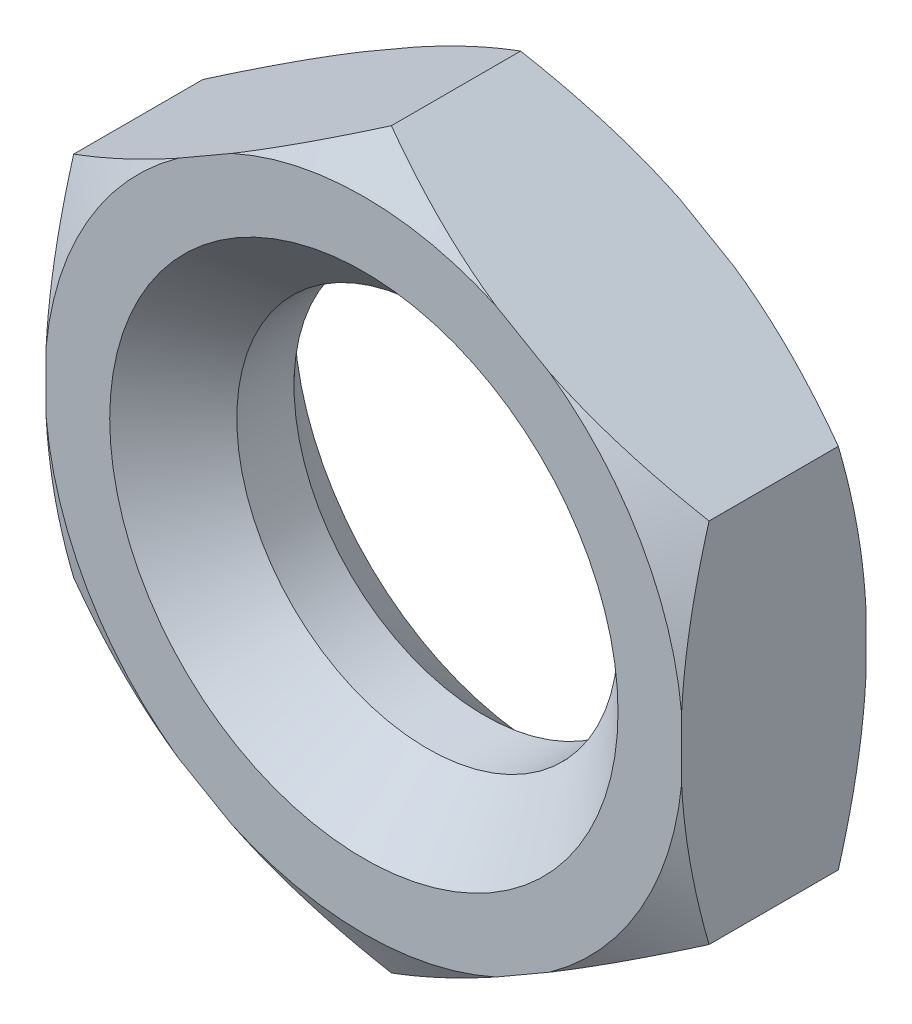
ISO-10303-21;
HEADER;
FILE_DESCRIPTION(('STEP AP214'),'2;1');
FILE_NAME('part.step','',(''),(''),'','','');
FILE_SCHEMA(('AUTOMOTIVE_DESIGN { 1 0 10303 214 1 1 1 1 }'));
ENDSEC;
DATA;
#1=APPLICATION_CONTEXT('core data for automotive mechanical design processes');
#2=APPLICATION_PROTOCOL_DEFINITION('international standard','automotive_design',2000,#1);
#3=PRODUCT_CONTEXT('',#1,'mechanical');
#4=PRODUCT('Part','Part','',(#3));
#5=PRODUCT_RELATED_PRODUCT_CATEGORY('part','',(#4));
#6=PRODUCT_DEFINITION_FORMATION('','',#4);
#7=PRODUCT_DEFINITION_CONTEXT('part definition',#1,'design');
#8=PRODUCT_DEFINITION('design','',#6,#7);
#9=PRODUCT_DEFINITION_SHAPE('','',#8);
#10=(LENGTH_UNIT() NAMED_UNIT(*) SI_UNIT(.MILLI.,.METRE.));
#11=(NAMED_UNIT(*) PLANE_ANGLE_UNIT() SI_UNIT($,.RADIAN.));
#12=(NAMED_UNIT(*) SI_UNIT($,.STERADIAN.) SOLID_ANGLE_UNIT());
#13=UNCERTAINTY_MEASURE_WITH_UNIT(LENGTH_MEASURE(1.E-05),#10,'distance_accuracy_value','');
#14=(GEOMETRIC_REPRESENTATION_CONTEXT(3) GLOBAL_UNCERTAINTY_ASSIGNED_CONTEXT((#13)) GLOBAL_UNIT_ASSIGNED_CONTEXT((#10,
#11,#12)) REPRESENTATION_CONTEXT('',''));
#15=CARTESIAN_POINT('',(0.,0.,0.));
#16=DIRECTION('',(0.,0.,1.));
#17=DIRECTION('',(1.,0.,0.));
#18=AXIS2_PLACEMENT_3D('',#15,#16,#17);
#19=CARTESIAN_POINT('',(5.,2.88675134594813,1.45));
#20=DIRECTION('',(-0.5,-0.866025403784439,0.));
#21=DIRECTION('',(0.866025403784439,-0.5,0.));
#22=AXIS2_PLACEMENT_3D('',#19,#20,#21);
#23=PLANE('',#22);
#24=CARTESIAN_POINT('',(-3.47403073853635,7.77923527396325,0.568533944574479));
#25=CARTESIAN_POINT('',(-3.316921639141,7.68852829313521,0.483747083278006));
#26=CARTESIAN_POINT('',(-3.15943680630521,7.59760438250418,0.399874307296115));
#27=CARTESIAN_POINT('',(-2.84355723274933,7.41523122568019,0.234386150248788));
#28=CARTESIAN_POINT('',(-2.68516238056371,7.32378191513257,0.152771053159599));
#29=CARTESIAN_POINT('',(-2.36683417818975,7.13999504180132,-0.00800836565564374));
#30=CARTESIAN_POINT('',(-2.20689752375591,7.04765557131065,-0.0871639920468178));
#31=CARTESIAN_POINT('',(-1.88582659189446,6.86228518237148,-0.242160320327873));
#32=CARTESIAN_POINT('',(-1.72469235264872,6.76925428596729,-0.318001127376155));
#33=CARTESIAN_POINT('',(-1.39690389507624,6.58000553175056,-0.46752614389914));
#34=CARTESIAN_POINT('',(-1.23021376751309,6.48376694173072,-0.541105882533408));
#35=CARTESIAN_POINT('',(-0.895170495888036,6.29032961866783,-0.683021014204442));
#36=CARTESIAN_POINT('',(-0.726817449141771,6.19313094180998,-0.751356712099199));
#37=CARTESIAN_POINT('',(-0.38838218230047,5.99773524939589,-0.881496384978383));
#38=CARTESIAN_POINT('',(-0.218301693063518,5.89953923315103,-0.943306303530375));
#39=CARTESIAN_POINT('',(0.123856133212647,5.70199432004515,-1.05896449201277));
#40=CARTESIAN_POINT('',(0.295933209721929,5.60264557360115,-1.11281378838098));
#41=CARTESIAN_POINT('',(0.707423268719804,5.36507167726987,-1.22929063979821));
#42=CARTESIAN_POINT('',(0.947794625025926,5.22629321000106,-1.28758929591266));
#43=CARTESIAN_POINT('',(1.3108188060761,5.0167011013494,-1.35768410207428));
#44=CARTESIAN_POINT('',(1.43223600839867,4.94660084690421,-1.37815664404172));
#45=CARTESIAN_POINT('',(1.67573729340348,4.80601531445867,-1.4128027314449));
#46=CARTESIAN_POINT('',(1.79782128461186,4.73553008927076,-1.42697711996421));
#47=CARTESIAN_POINT('',(2.04102257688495,4.59511775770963,-1.44849722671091));
#48=CARTESIAN_POINT('',(2.16213473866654,4.52519361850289,-1.45591998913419));
#49=CARTESIAN_POINT('',(2.40452883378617,4.3852473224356,-1.46399542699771));
#50=CARTESIAN_POINT('',(2.52581076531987,4.31522516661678,-1.46464817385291));
#51=CARTESIAN_POINT('',(2.7682581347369,4.17524811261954,-1.45916287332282));
#52=CARTESIAN_POINT('',(2.88942357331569,4.10529321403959,-1.4530248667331));
#53=CARTESIAN_POINT('',(3.13138023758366,3.96559946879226,-1.43414390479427));
#54=CARTESIAN_POINT('',(3.25217140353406,3.89586065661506,-1.42139994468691));
#55=CARTESIAN_POINT('',(3.53740480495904,3.73118107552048,-1.38383025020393));
#56=CARTESIAN_POINT('',(3.7015805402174,3.63639417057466,-1.35628593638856));
#57=CARTESIAN_POINT('',(4.0283637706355,3.44772578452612,-1.29079454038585));
#58=CARTESIAN_POINT('',(4.19097103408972,3.35384443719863,-1.25284594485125));
#59=CARTESIAN_POINT('',(4.51459604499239,3.16699945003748,-1.16797835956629));
#60=CARTESIAN_POINT('',(4.67561177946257,3.07403697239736,-1.12104924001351));
#61=CARTESIAN_POINT('',(4.99583706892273,2.88915481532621,-1.01969926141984));
#62=CARTESIAN_POINT('',(5.15504673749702,2.79723507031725,-0.965278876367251));
#63=CARTESIAN_POINT('',(5.47365870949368,2.61328436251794,-0.849553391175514));
#64=CARTESIAN_POINT('',(5.63304057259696,2.52126520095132,-0.78817377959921));
#65=CARTESIAN_POINT('',(5.9501156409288,2.33820182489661,-0.660251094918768));
#66=CARTESIAN_POINT('',(6.1078098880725,2.24715700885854,-0.593711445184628));
#67=CARTESIAN_POINT('',(6.42176069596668,2.06589742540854,-0.456383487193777));
#68=CARTESIAN_POINT('',(6.57801755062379,1.97568248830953,-0.385596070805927));
#69=CARTESIAN_POINT('',(6.88930539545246,1.79596036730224,-0.240515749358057));
#70=CARTESIAN_POINT('',(7.04433636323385,1.70645319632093,-0.166222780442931));
#71=CARTESIAN_POINT('',(7.30657722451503,1.55504836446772,-0.0376590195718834));
#72=CARTESIAN_POINT('',(7.41406189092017,1.49299206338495,0.0158676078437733));
#73=CARTESIAN_POINT('',(7.6285576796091,1.36915286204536,0.124159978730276));
#74=CARTESIAN_POINT('',(7.73556881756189,1.30736995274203,0.178925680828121));
#75=CARTESIAN_POINT('',(7.94803396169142,1.18470314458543,0.28896299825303));
#76=CARTESIAN_POINT('',(8.05349244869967,1.12381665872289,0.344223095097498));
#77=CARTESIAN_POINT('',(8.26403397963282,1.00226044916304,0.455694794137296));
#78=CARTESIAN_POINT('',(8.36911701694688,0.941590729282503,0.511906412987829));
#79=CARTESIAN_POINT('',(8.47403073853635,0.881018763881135,0.568533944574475));
#80=B_SPLINE_CURVE_WITH_KNOTS('',3,(#24,#25,#26,#27,#28,#29,#30,#31,#32,#33,#34,#35,#36,#37,#38,
#39,#40,#41,#42,#43,#44,#45,#46,#47,#48,#49,#50,#51,#52,#53,#54,#55,#56,#57,#58,#59,#60,#61,#62,
#63,#64,#65,#66,#67,#68,#69,#70,#71,#72,#73,#74,#75,#76,#77,#78,#79),.UNSPECIFIED.,.F.,.F.,(4,2,
2,2,2,2,2,2,2,2,2,2,2,2,2,2,2,2,2,2,2,2,2,2,2,2,2,4),(0.,0.60075473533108,1.20158469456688,
1.80434076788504,2.40707770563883,3.02520064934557,3.64328763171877,4.26080672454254,
4.87824612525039,5.72816417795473,6.15310900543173,6.57799693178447,6.99797322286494,
7.41794508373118,7.83791442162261,8.2579476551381,8.832293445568,9.406722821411,
9.98180399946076,10.5568488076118,11.1387664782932,11.7203013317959,12.3017145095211,
12.8831382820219,13.2886206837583,13.694089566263,14.0952599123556,14.4964372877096),.UNSPECIFIED.);
#81=CARTESIAN_POINT('',(0.,5.77350269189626,-1.01698729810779));
#82=VERTEX_POINT('',#81);
#83=CARTESIAN_POINT('',(2.07966147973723,4.57280957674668,-1.45));
#84=VERTEX_POINT('',#83);
#85=EDGE_CURVE('E177',#82,#84,#80,.T.);
#86=ORIENTED_EDGE('',*,*,#85,.F.);
#87=DIRECTION('',(0.,0.,-1.));
#88=VECTOR('',#87,1.);
#89=CARTESIAN_POINT('',(0.,5.77350269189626,1.45));
#90=LINE('',#89,#88);
#91=CARTESIAN_POINT('',(0.,5.77350269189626,1.01698729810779));
#92=VERTEX_POINT('',#91);
#93=EDGE_CURVE('E223',#92,#82,#90,.T.);
#94=ORIENTED_EDGE('',*,*,#93,.F.);
#95=CARTESIAN_POINT('',(8.47403073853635,0.881018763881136,-0.568533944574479));
#96=CARTESIAN_POINT('',(8.316921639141,0.97172574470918,-0.483747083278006));
#97=CARTESIAN_POINT('',(8.15943680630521,1.0626496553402,-0.399874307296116));
#98=CARTESIAN_POINT('',(7.84355723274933,1.2450228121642,-0.234386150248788));
#99=CARTESIAN_POINT('',(7.6851623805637,1.33647212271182,-0.152771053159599));
#100=CARTESIAN_POINT('',(7.36683417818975,1.52025899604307,0.00800836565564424));
#101=CARTESIAN_POINT('',(7.20689752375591,1.61259846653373,0.0871639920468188));
#102=CARTESIAN_POINT('',(6.88582659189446,1.79796885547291,0.242160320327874));
#103=CARTESIAN_POINT('',(6.72469235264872,1.8909997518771,0.318001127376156));
#104=CARTESIAN_POINT('',(6.39690389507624,2.08024850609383,0.46752614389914));
#105=CARTESIAN_POINT('',(6.23021376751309,2.17648709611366,0.54110588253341));
#106=CARTESIAN_POINT('',(5.89517049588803,2.36992441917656,0.683021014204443));
#107=CARTESIAN_POINT('',(5.72681744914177,2.46712309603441,0.7513567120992));
#108=CARTESIAN_POINT('',(5.38838218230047,2.6625187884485,0.881496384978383));
#109=CARTESIAN_POINT('',(5.21830169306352,2.76071480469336,0.943306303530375));
#110=CARTESIAN_POINT('',(4.87614386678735,2.95825971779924,1.05896449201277));
#111=CARTESIAN_POINT('',(4.70406679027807,3.05760846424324,1.11281378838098));
#112=CARTESIAN_POINT('',(4.2925767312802,3.29518236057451,1.22929063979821));
#113=CARTESIAN_POINT('',(4.05220537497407,3.43396082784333,1.28758929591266));
#114=CARTESIAN_POINT('',(3.6891811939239,3.64355293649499,1.35768410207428));
#115=CARTESIAN_POINT('',(3.56776399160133,3.71365319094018,1.37815664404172));
#116=CARTESIAN_POINT('',(3.32426270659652,3.85423872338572,1.4128027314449));
#117=CARTESIAN_POINT('',(3.20217871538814,3.92472394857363,1.42697711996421));
#118=CARTESIAN_POINT('',(2.95897742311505,4.06513628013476,1.44849722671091));
#119=CARTESIAN_POINT('',(2.83786526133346,4.1350604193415,1.45591998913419));
#120=CARTESIAN_POINT('',(2.59547116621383,4.27500671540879,1.46399542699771));
#121=CARTESIAN_POINT('',(2.47418923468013,4.34502887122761,1.46464817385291));
#122=CARTESIAN_POINT('',(2.2317418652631,4.48500592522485,1.45916287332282));
#123=CARTESIAN_POINT('',(2.11057642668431,4.5549608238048,1.4530248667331));
#124=CARTESIAN_POINT('',(1.86861976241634,4.69465456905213,1.43414390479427));
#125=CARTESIAN_POINT('',(1.74782859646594,4.76439338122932,1.42139994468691));
#126=CARTESIAN_POINT('',(1.46259519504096,4.92907296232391,1.38383025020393));
#127=CARTESIAN_POINT('',(1.2984194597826,5.02385986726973,1.35628593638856));
#128=CARTESIAN_POINT('',(0.971636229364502,5.21252825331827,1.29079454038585));
#129=CARTESIAN_POINT('',(0.809028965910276,5.30640960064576,1.25284594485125));
#130=CARTESIAN_POINT('',(0.485403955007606,5.49325458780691,1.16797835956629));
#131=CARTESIAN_POINT('',(0.324388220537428,5.58621706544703,1.12104924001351));
#132=CARTESIAN_POINT('',(0.00416293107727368,5.77109922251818,1.01969926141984));
#133=CARTESIAN_POINT('',(-0.155046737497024,5.86301896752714,0.965278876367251));
#134=CARTESIAN_POINT('',(-0.473658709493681,6.04696967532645,0.849553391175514));
#135=CARTESIAN_POINT('',(-0.633040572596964,6.13898883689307,0.788173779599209));
#136=CARTESIAN_POINT('',(-0.950115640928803,6.32205221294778,0.660251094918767));
#137=CARTESIAN_POINT('',(-1.1078098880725,6.41309702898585,0.593711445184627));
#138=CARTESIAN_POINT('',(-1.42176069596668,6.59435661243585,0.456383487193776));
#139=CARTESIAN_POINT('',(-1.57801755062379,6.68457154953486,0.385596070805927));
#140=CARTESIAN_POINT('',(-1.88930539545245,6.86429367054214,0.240515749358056));
#141=CARTESIAN_POINT('',(-2.04433636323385,6.95380084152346,0.16622278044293));
#142=CARTESIAN_POINT('',(-2.30657722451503,7.10520567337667,0.037659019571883));
#143=CARTESIAN_POINT('',(-2.41406189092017,7.16726197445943,-0.0158676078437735));
#144=CARTESIAN_POINT('',(-2.62855767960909,7.29110117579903,-0.124159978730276));
#145=CARTESIAN_POINT('',(-2.73556881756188,7.35288408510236,-0.178925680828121));
#146=CARTESIAN_POINT('',(-2.94803396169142,7.47555089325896,-0.288962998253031));
#147=CARTESIAN_POINT('',(-3.05349244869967,7.5364373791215,-0.344223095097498));
#148=CARTESIAN_POINT('',(-3.26403397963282,7.65799358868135,-0.455694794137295));
#149=CARTESIAN_POINT('',(-3.36911701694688,7.71866330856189,-0.511906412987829));
#150=CARTESIAN_POINT('',(-3.47403073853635,7.77923527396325,-0.568533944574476));
#151=B_SPLINE_CURVE_WITH_KNOTS('',3,(#95,#96,#97,#98,#99,#100,#101,#102,#103,#104,#105,#106,
#107,#108,#109,#110,#111,#112,#113,#114,#115,#116,#117,#118,#119,#120,#121,#122,#123,#124,#125,
#126,#127,#128,#129,#130,#131,#132,#133,#134,#135,#136,#137,#138,#139,#140,#141,#142,#143,#144,
#145,#146,#147,#148,#149,#150),.UNSPECIFIED.,.F.,.F.,(4,2,2,2,2,2,2,2,2,2,2,2,2,2,2,2,2,2,2,2,2,
2,2,2,2,2,2,4),(0.,0.600754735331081,1.20158469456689,1.80434076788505,2.40707770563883,
3.02520064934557,3.64328763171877,4.26080672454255,4.8782461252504,5.72816417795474,
6.15310900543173,6.57799693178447,6.99797322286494,7.41794508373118,7.83791442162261,
8.2579476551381,8.832293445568,9.406722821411,9.98180399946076,10.5568488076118,
11.1387664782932,11.7203013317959,12.3017145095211,12.8831382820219,13.2886206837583,
13.694089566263,14.0952599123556,14.4964372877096),.UNSPECIFIED.);
#152=CARTESIAN_POINT('',(2.07966147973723,4.57280957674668,1.45));
#153=VERTEX_POINT('',#152);
#154=EDGE_CURVE('E374',#153,#92,#151,.T.);
#155=ORIENTED_EDGE('',*,*,#154,.F.);
#156=DIRECTION('',(-0.866025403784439,0.5,0.));
#157=VECTOR('',#156,1.);
#158=CARTESIAN_POINT('',(5.,2.88675134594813,1.45));
#159=LINE('',#158,#157);
#160=CARTESIAN_POINT('',(2.92033852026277,4.08744446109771,1.45));
#161=VERTEX_POINT('',#160);
#162=EDGE_CURVE('E352',#161,#153,#159,.T.);
#163=ORIENTED_EDGE('',*,*,#162,.F.);
#164=CARTESIAN_POINT('',(5.,2.88675134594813,1.01698729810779));
#165=VERTEX_POINT('',#164);
#166=EDGE_CURVE('E194',#165,#161,#151,.T.);
#167=ORIENTED_EDGE('',*,*,#166,.F.);
#168=DIRECTION('',(0.,0.,-1.));
#169=VECTOR('',#168,1.);
#170=CARTESIAN_POINT('',(5.,2.88675134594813,1.45));
#171=LINE('',#170,#169);
#172=CARTESIAN_POINT('',(5.,2.88675134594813,-1.01698729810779));
#173=VERTEX_POINT('',#172);
#174=EDGE_CURVE('E183',#165,#173,#171,.T.);
#175=ORIENTED_EDGE('',*,*,#174,.T.);
#176=CARTESIAN_POINT('',(2.92033852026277,4.08744446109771,-1.45));
#177=VERTEX_POINT('',#176);
#178=EDGE_CURVE('E164',#177,#173,#80,.T.);
#179=ORIENTED_EDGE('',*,*,#178,.F.);
#180=DIRECTION('',(-0.866025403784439,0.5,0.));
#181=VECTOR('',#180,1.);
#182=CARTESIAN_POINT('',(5.,2.88675134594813,-1.45));
#183=LINE('',#182,#181);
#184=EDGE_CURVE('E264',#177,#84,#183,.T.);
#185=ORIENTED_EDGE('',*,*,#184,.T.);
#186=EDGE_LOOP('',(#86,#94,#155,#163,#167,#175,#179,#185));
#187=FACE_BOUND('',#186,.T.);
#188=ADVANCED_FACE('F39',(#187),#23,.F.);
#189=CARTESIAN_POINT('',(0.,5.77350269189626,1.45));
#190=DIRECTION('',(0.5,-0.866025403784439,0.));
#191=DIRECTION('',(0.866025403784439,0.5,0.));
#192=AXIS2_PLACEMENT_3D('',#189,#190,#191);
#193=PLANE('',#192);
#194=CARTESIAN_POINT('',(-8.47403073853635,0.881018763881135,0.568533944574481));
#195=CARTESIAN_POINT('',(-8.316921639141,0.971725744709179,0.483747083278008));
#196=CARTESIAN_POINT('',(-8.15943680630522,1.0626496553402,0.399874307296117));
#197=CARTESIAN_POINT('',(-7.84355723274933,1.2450228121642,0.234386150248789));
#198=CARTESIAN_POINT('',(-7.68516238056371,1.33647212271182,0.152771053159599));
#199=CARTESIAN_POINT('',(-7.36683417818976,1.52025899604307,-0.00800836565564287));
#200=CARTESIAN_POINT('',(-7.20689752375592,1.61259846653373,-0.0871639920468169));
#201=CARTESIAN_POINT('',(-6.88582659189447,1.79796885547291,-0.242160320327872));
#202=CARTESIAN_POINT('',(-6.72469235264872,1.8909997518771,-0.318001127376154));
#203=CARTESIAN_POINT('',(-6.39690389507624,2.08024850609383,-0.467526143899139));
#204=CARTESIAN_POINT('',(-6.23021376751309,2.17648709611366,-0.541105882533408));
#205=CARTESIAN_POINT('',(-5.89517049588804,2.36992441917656,-0.683021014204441));
#206=CARTESIAN_POINT('',(-5.72681744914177,2.46712309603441,-0.751356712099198));
#207=CARTESIAN_POINT('',(-5.38838218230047,2.6625187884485,-0.881496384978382));
#208=CARTESIAN_POINT('',(-5.21830169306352,2.76071480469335,-0.943306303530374));
#209=CARTESIAN_POINT('',(-4.87614386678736,2.95825971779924,-1.05896449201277));
#210=CARTESIAN_POINT('',(-4.70406679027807,3.05760846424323,-1.11281378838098));
#211=CARTESIAN_POINT('',(-4.2925767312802,3.29518236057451,-1.22929063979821));
#212=CARTESIAN_POINT('',(-4.05220537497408,3.43396082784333,-1.28758929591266));
#213=CARTESIAN_POINT('',(-3.68918119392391,3.64355293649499,-1.35768410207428));
#214=CARTESIAN_POINT('',(-3.56776399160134,3.71365319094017,-1.37815664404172));
#215=CARTESIAN_POINT('',(-3.32426270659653,3.85423872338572,-1.4128027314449));
#216=CARTESIAN_POINT('',(-3.20217871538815,3.92472394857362,-1.42697711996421));
#217=CARTESIAN_POINT('',(-2.95897742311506,4.06513628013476,-1.44849722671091));
#218=CARTESIAN_POINT('',(-2.83786526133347,4.13506041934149,-1.45591998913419));
#219=CARTESIAN_POINT('',(-2.59547116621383,4.27500671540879,-1.46399542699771));
#220=CARTESIAN_POINT('',(-2.47418923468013,4.34502887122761,-1.46464817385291));
#221=CARTESIAN_POINT('',(-2.2317418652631,4.48500592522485,-1.45916287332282));
#222=CARTESIAN_POINT('',(-2.11057642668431,4.55496082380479,-1.4530248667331));
#223=CARTESIAN_POINT('',(-1.86861976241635,4.69465456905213,-1.43414390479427));
#224=CARTESIAN_POINT('',(-1.74782859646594,4.76439338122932,-1.42139994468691));
#225=CARTESIAN_POINT('',(-1.46259519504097,4.9290729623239,-1.38383025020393));
#226=CARTESIAN_POINT('',(-1.2984194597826,5.02385986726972,-1.35628593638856));
#227=CARTESIAN_POINT('',(-0.971636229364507,5.21252825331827,-1.29079454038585));
#228=CARTESIAN_POINT('',(-0.809028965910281,5.30640960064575,-1.25284594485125));
#229=CARTESIAN_POINT('',(-0.485403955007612,5.4932545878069,-1.16797835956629));
#230=CARTESIAN_POINT('',(-0.324388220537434,5.58621706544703,-1.12104924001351));
#231=CARTESIAN_POINT('',(-0.00416293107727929,5.77109922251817,-1.01969926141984));
#232=CARTESIAN_POINT('',(0.155046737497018,5.86301896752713,-0.965278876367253));
#233=CARTESIAN_POINT('',(0.473658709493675,6.04696967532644,-0.849553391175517));
#234=CARTESIAN_POINT('',(0.633040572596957,6.13898883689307,-0.788173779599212));
#235=CARTESIAN_POINT('',(0.950115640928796,6.32205221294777,-0.66025109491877));
#236=CARTESIAN_POINT('',(1.10780988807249,6.41309702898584,-0.59371144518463));
#237=CARTESIAN_POINT('',(1.42176069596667,6.59435661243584,-0.45638348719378));
#238=CARTESIAN_POINT('',(1.57801755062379,6.68457154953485,-0.385596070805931));
#239=CARTESIAN_POINT('',(1.88930539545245,6.86429367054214,-0.240515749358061));
#240=CARTESIAN_POINT('',(2.04433636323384,6.95380084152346,-0.166222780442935));
#241=CARTESIAN_POINT('',(2.30657722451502,7.10520567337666,-0.0376590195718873));
#242=CARTESIAN_POINT('',(2.41406189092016,7.16726197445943,0.0158676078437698));
#243=CARTESIAN_POINT('',(2.62855767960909,7.29110117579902,0.124159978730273));
#244=CARTESIAN_POINT('',(2.73556881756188,7.35288408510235,0.178925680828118));
#245=CARTESIAN_POINT('',(2.94803396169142,7.47555089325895,0.288962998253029));
#246=CARTESIAN_POINT('',(3.05349244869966,7.5364373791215,0.344223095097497));
#247=CARTESIAN_POINT('',(3.26403397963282,7.65799358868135,0.455694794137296));
#248=CARTESIAN_POINT('',(3.36911701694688,7.71866330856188,0.51190641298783));
#249=CARTESIAN_POINT('',(3.47403073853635,7.77923527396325,0.568533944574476));
#250=B_SPLINE_CURVE_WITH_KNOTS('',3,(#194,#195,#196,#197,#198,#199,#200,#201,#202,#203,#204,
#205,#206,#207,#208,#209,#210,#211,#212,#213,#214,#215,#216,#217,#218,#219,#220,#221,#222,#223,
#224,#225,#226,#227,#228,#229,#230,#231,#232,#233,#234,#235,#236,#237,#238,#239,#240,#241,#242,
#243,#244,#245,#246,#247,#248,#249),.UNSPECIFIED.,.F.,.F.,(4,2,2,2,2,2,2,2,2,2,2,2,2,2,2,2,2,2,
2,2,2,2,2,2,2,2,2,4),(0.,0.600754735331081,1.20158469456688,1.80434076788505,2.40707770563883,
3.02520064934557,3.64328763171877,4.26080672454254,4.8782461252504,5.72816417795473,
6.15310900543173,6.57799693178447,6.99797322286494,7.41794508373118,7.83791442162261,
8.2579476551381,8.832293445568,9.406722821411,9.98180399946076,10.5568488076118,
11.1387664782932,11.7203013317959,12.3017145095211,12.8831382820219,13.2886206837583,
13.694089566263,14.0952599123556,14.4964372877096),.UNSPECIFIED.);
#251=CARTESIAN_POINT('',(-5.,2.88675134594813,-1.01698729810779));
#252=VERTEX_POINT('',#251);
#253=CARTESIAN_POINT('',(-2.92033852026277,4.08744446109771,-1.45));
#254=VERTEX_POINT('',#253);
#255=EDGE_CURVE('E55',#252,#254,#250,.T.);
#256=ORIENTED_EDGE('',*,*,#255,.F.);
#257=DIRECTION('',(0.,0.,-1.));
#258=VECTOR('',#257,1.);
#259=CARTESIAN_POINT('',(-5.,2.88675134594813,1.45));
#260=LINE('',#259,#258);
#261=CARTESIAN_POINT('',(-5.,2.88675134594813,1.01698729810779));
#262=VERTEX_POINT('',#261);
#263=EDGE_CURVE('E219',#262,#252,#260,.T.);
#264=ORIENTED_EDGE('',*,*,#263,.F.);
#265=CARTESIAN_POINT('',(3.47403073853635,7.77923527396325,-0.56853394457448));
#266=CARTESIAN_POINT('',(3.316921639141,7.68852829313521,-0.483747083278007));
#267=CARTESIAN_POINT('',(3.15943680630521,7.59760438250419,-0.399874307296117));
#268=CARTESIAN_POINT('',(2.84355723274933,7.41523122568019,-0.234386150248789));
#269=CARTESIAN_POINT('',(2.68516238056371,7.32378191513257,-0.152771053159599));
#270=CARTESIAN_POINT('',(2.36683417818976,7.13999504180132,0.00800836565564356));
#271=CARTESIAN_POINT('',(2.20689752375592,7.04765557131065,0.0871639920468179));
#272=CARTESIAN_POINT('',(1.88582659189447,6.86228518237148,0.242160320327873));
#273=CARTESIAN_POINT('',(1.72469235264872,6.76925428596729,0.318001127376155));
#274=CARTESIAN_POINT('',(1.39690389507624,6.58000553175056,0.467526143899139));
#275=CARTESIAN_POINT('',(1.23021376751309,6.48376694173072,0.541105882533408));
#276=CARTESIAN_POINT('',(0.895170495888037,6.29032961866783,0.683021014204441));
#277=CARTESIAN_POINT('',(0.726817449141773,6.19313094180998,0.751356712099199));
#278=CARTESIAN_POINT('',(0.388382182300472,5.99773524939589,0.881496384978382));
#279=CARTESIAN_POINT('',(0.21830169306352,5.89953923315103,0.943306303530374));
#280=CARTESIAN_POINT('',(-0.123856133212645,5.70199432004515,1.05896449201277));
#281=CARTESIAN_POINT('',(-0.295933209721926,5.60264557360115,1.11281378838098));
#282=CARTESIAN_POINT('',(-0.707423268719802,5.36507167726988,1.22929063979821));
#283=CARTESIAN_POINT('',(-0.947794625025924,5.22629321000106,1.28758929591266));
#284=CARTESIAN_POINT('',(-1.3108188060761,5.0167011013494,1.35768410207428));
#285=CARTESIAN_POINT('',(-1.43223600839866,4.94660084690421,1.37815664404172));
#286=CARTESIAN_POINT('',(-1.67573729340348,4.80601531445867,1.4128027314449));
#287=CARTESIAN_POINT('',(-1.79782128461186,4.73553008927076,1.42697711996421));
#288=CARTESIAN_POINT('',(-2.04102257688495,4.59511775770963,1.44849722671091));
#289=CARTESIAN_POINT('',(-2.16213473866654,4.52519361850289,1.45591998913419));
#290=CARTESIAN_POINT('',(-2.40452883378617,4.3852473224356,1.46399542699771));
#291=CARTESIAN_POINT('',(-2.52581076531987,4.31522516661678,1.46464817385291));
#292=CARTESIAN_POINT('',(-2.7682581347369,4.17524811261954,1.45916287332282));
#293=CARTESIAN_POINT('',(-2.88942357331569,4.10529321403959,1.4530248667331));
#294=CARTESIAN_POINT('',(-3.13138023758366,3.96559946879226,1.43414390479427));
#295=CARTESIAN_POINT('',(-3.25217140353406,3.89586065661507,1.42139994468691));
#296=CARTESIAN_POINT('',(-3.53740480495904,3.73118107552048,1.38383025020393));
#297=CARTESIAN_POINT('',(-3.7015805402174,3.63639417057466,1.35628593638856));
#298=CARTESIAN_POINT('',(-4.02836377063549,3.44772578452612,1.29079454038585));
#299=CARTESIAN_POINT('',(-4.19097103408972,3.35384443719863,1.25284594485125));
#300=CARTESIAN_POINT('',(-4.51459604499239,3.16699945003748,1.16797835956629));
#301=CARTESIAN_POINT('',(-4.67561177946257,3.07403697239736,1.12104924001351));
#302=CARTESIAN_POINT('',(-4.99583706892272,2.88915481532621,1.01969926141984));
#303=CARTESIAN_POINT('',(-5.15504673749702,2.79723507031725,0.965278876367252));
#304=CARTESIAN_POINT('',(-5.47365870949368,2.61328436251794,0.849553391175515));
#305=CARTESIAN_POINT('',(-5.63304057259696,2.52126520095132,0.788173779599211));
#306=CARTESIAN_POINT('',(-5.9501156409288,2.33820182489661,0.660251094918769));
#307=CARTESIAN_POINT('',(-6.1078098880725,2.24715700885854,0.593711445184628));
#308=CARTESIAN_POINT('',(-6.42176069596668,2.06589742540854,0.456383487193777));
#309=CARTESIAN_POINT('',(-6.57801755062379,1.97568248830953,0.385596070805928));
#310=CARTESIAN_POINT('',(-6.88930539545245,1.79596036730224,0.240515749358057));
#311=CARTESIAN_POINT('',(-7.04433636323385,1.70645319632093,0.166222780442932));
#312=CARTESIAN_POINT('',(-7.30657722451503,1.55504836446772,0.0376590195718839));
#313=CARTESIAN_POINT('',(-7.41406189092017,1.49299206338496,-0.015867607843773));
#314=CARTESIAN_POINT('',(-7.6285576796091,1.36915286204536,-0.124159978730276));
#315=CARTESIAN_POINT('',(-7.73556881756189,1.30736995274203,-0.178925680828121));
#316=CARTESIAN_POINT('',(-7.94803396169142,1.18470314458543,-0.288962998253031));
#317=CARTESIAN_POINT('',(-8.05349244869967,1.12381665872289,-0.344223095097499));
#318=CARTESIAN_POINT('',(-8.26403397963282,1.00226044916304,-0.455694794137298));
#319=CARTESIAN_POINT('',(-8.36911701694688,0.941590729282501,-0.511906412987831));
#320=CARTESIAN_POINT('',(-8.47403073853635,0.881018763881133,-0.568533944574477));
#321=B_SPLINE_CURVE_WITH_KNOTS('',3,(#265,#266,#267,#268,#269,#270,#271,#272,#273,#274,#275,
#276,#277,#278,#279,#280,#281,#282,#283,#284,#285,#286,#287,#288,#289,#290,#291,#292,#293,#294,
#295,#296,#297,#298,#299,#300,#301,#302,#303,#304,#305,#306,#307,#308,#309,#310,#311,#312,#313,
#314,#315,#316,#317,#318,#319,#320),.UNSPECIFIED.,.F.,.F.,(4,2,2,2,2,2,2,2,2,2,2,2,2,2,2,2,2,2,
2,2,2,2,2,2,2,2,2,4),(0.,0.60075473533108,1.20158469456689,1.80434076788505,2.40707770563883,
3.02520064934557,3.64328763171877,4.26080672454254,4.87824612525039,5.72816417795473,
6.15310900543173,6.57799693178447,6.99797322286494,7.41794508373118,7.83791442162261,
8.2579476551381,8.832293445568,9.406722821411,9.98180399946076,10.5568488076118,
11.1387664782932,11.7203013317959,12.3017145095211,12.8831382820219,13.2886206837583,
13.694089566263,14.0952599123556,14.4964372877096),.UNSPECIFIED.);
#322=CARTESIAN_POINT('',(-2.92033852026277,4.08744446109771,1.45));
#323=VERTEX_POINT('',#322);
#324=EDGE_CURVE('E345',#323,#262,#321,.T.);
#325=ORIENTED_EDGE('',*,*,#324,.F.);
#326=DIRECTION('',(-0.866025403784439,-0.5,0.));
#327=VECTOR('',#326,1.);
#328=CARTESIAN_POINT('',(0.,5.77350269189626,1.45));
#329=LINE('',#328,#327);
#330=CARTESIAN_POINT('',(-2.07966147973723,4.57280957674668,1.45));
#331=VERTEX_POINT('',#330);
#332=EDGE_CURVE('E356',#331,#323,#329,.T.);
#333=ORIENTED_EDGE('',*,*,#332,.F.);
#334=EDGE_CURVE('E351',#92,#331,#321,.T.);
#335=ORIENTED_EDGE('',*,*,#334,.F.);
#336=ORIENTED_EDGE('',*,*,#93,.T.);
#337=CARTESIAN_POINT('',(-2.07966147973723,4.57280957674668,-1.45));
#338=VERTEX_POINT('',#337);
#339=EDGE_CURVE('E432',#338,#82,#250,.T.);
#340=ORIENTED_EDGE('',*,*,#339,.F.);
#341=DIRECTION('',(-0.866025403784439,-0.5,0.));
#342=VECTOR('',#341,1.);
#343=CARTESIAN_POINT('',(0.,5.77350269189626,-1.45));
#344=LINE('',#343,#342);
#345=EDGE_CURVE('E373',#338,#254,#344,.T.);
#346=ORIENTED_EDGE('',*,*,#345,.T.);
#347=EDGE_LOOP('',(#256,#264,#325,#333,#335,#336,#340,#346));
#348=FACE_BOUND('',#347,.T.);
#349=ADVANCED_FACE('F325',(#348),#193,.F.);
#350=CARTESIAN_POINT('',(-5.,2.88675134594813,1.45));
#351=DIRECTION('',(1.,0.,0.));
#352=DIRECTION('',(0.,0.,-1.));
#353=AXIS2_PLACEMENT_3D('',#350,#351,#352);
#354=PLANE('',#353);
#355=CARTESIAN_POINT('',(-5.,-6.36078208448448,0.320851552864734));
#356=CARTESIAN_POINT('',(-5.,-6.18013308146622,0.238876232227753));
#357=CARTESIAN_POINT('',(-5.,-5.99899018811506,0.157968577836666));
#358=CARTESIAN_POINT('',(-5.,-5.63550504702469,-0.00119337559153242));
#359=CARTESIAN_POINT('',(-5.,-5.45316258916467,-0.0794471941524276));
#360=CARTESIAN_POINT('',(-5.,-5.08636806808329,-0.233073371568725));
#361=CARTESIAN_POINT('',(-5.,-4.90191037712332,-0.30843234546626));
#362=CARTESIAN_POINT('',(-5.,-4.53143633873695,-0.455206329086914));
#363=CARTESIAN_POINT('',(-5.,-4.34542006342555,-0.526621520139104));
#364=CARTESIAN_POINT('',(-5.,-3.97243139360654,-0.664322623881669));
#365=CARTESIAN_POINT('',(-5.,-3.78546695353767,-0.730629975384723));
#366=CARTESIAN_POINT('',(-5.,-3.40953889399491,-0.857390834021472));
#367=CARTESIAN_POINT('',(-5.,-3.22057516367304,-0.917844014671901));
#368=CARTESIAN_POINT('',(-5.,-2.84074841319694,-1.03150987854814));
#369=CARTESIAN_POINT('',(-5.,-2.64988834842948,-1.08473236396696));
#370=CARTESIAN_POINT('',(-5.,-2.26594093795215,-1.18252260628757));
#371=CARTESIAN_POINT('',(-5.,-2.07285368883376,-1.22709073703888));
#372=CARTESIAN_POINT('',(-5.,-1.73954503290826,-1.2947767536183));
#373=CARTESIAN_POINT('',(-5.,-1.59983122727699,-1.32039534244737));
#374=CARTESIAN_POINT('',(-5.,-1.31946697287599,-1.36575503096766));
#375=CARTESIAN_POINT('',(-5.,-1.17881668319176,-1.38549710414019));
#376=CARTESIAN_POINT('',(-5.,-0.896786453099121,-1.41858786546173));
#377=CARTESIAN_POINT('',(-5.,-0.755406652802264,-1.43193773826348));
#378=CARTESIAN_POINT('',(-5.,-0.472166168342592,-1.45186202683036));
#379=CARTESIAN_POINT('',(-5.,-0.330305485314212,-1.45843645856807));
#380=CARTESIAN_POINT('',(-5.,-0.0465043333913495,-1.46460479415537));
#381=CARTESIAN_POINT('',(-5.,0.0954360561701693,-1.46420231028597));
#382=CARTESIAN_POINT('',(-5.,0.379123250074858,-1.45643876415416));
#383=CARTESIAN_POINT('',(-5.,0.520870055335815,-1.44907773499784));
#384=CARTESIAN_POINT('',(-5.,0.80385512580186,-1.42762165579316));
#385=CARTESIAN_POINT('',(-5.,0.945093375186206,-1.41352639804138));
#386=CARTESIAN_POINT('',(-5.,1.22680489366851,-1.37900907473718));
#387=CARTESIAN_POINT('',(-5.,1.36727801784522,-1.35858585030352));
#388=CARTESIAN_POINT('',(-5.,1.92740303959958,-1.26523614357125));
#389=CARTESIAN_POINT('',(-5.,2.34328466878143,-1.16902034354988));
#390=CARTESIAN_POINT('',(-5.,2.95941822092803,-0.997434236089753));
#391=CARTESIAN_POINT('',(-5.,3.16378258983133,-0.935594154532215));
#392=CARTESIAN_POINT('',(-5.,3.57015277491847,-0.804542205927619));
#393=CARTESIAN_POINT('',(-5.,3.77215875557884,-0.735330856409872));
#394=CARTESIAN_POINT('',(-5.,4.17632758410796,-0.590162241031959));
#395=CARTESIAN_POINT('',(-5.,4.3784655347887,-0.514136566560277));
#396=CARTESIAN_POINT('',(-5.,4.78085341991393,-0.357219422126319));
#397=CARTESIAN_POINT('',(-5.,4.9811032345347,-0.276327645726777));
#398=CARTESIAN_POINT('',(-5.,5.3787273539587,-0.11114956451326));
#399=CARTESIAN_POINT('',(-5.,5.57611180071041,-0.0268875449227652));
#400=CARTESIAN_POINT('',(-5.,5.96944983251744,0.144787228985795));
#401=CARTESIAN_POINT('',(-5.,6.16540375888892,0.232199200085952));
#402=CARTESIAN_POINT('',(-5.,6.36078208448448,0.320851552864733));
#403=B_SPLINE_CURVE_WITH_KNOTS('',3,(#355,#356,#357,#358,#359,#360,#361,#362,#363,#364,#365,
#366,#367,#368,#369,#370,#371,#372,#373,#374,#375,#376,#377,#378,#379,#380,#381,#382,#383,#384,
#385,#386,#387,#388,#389,#390,#391,#392,#393,#394,#395,#396,#397,#398,#399,#400,#401,#402),
.UNSPECIFIED.,.F.,.F.,(4,2,2,2,2,2,2,2,2,2,2,2,2,2,2,2,2,2,2,2,2,2,2,4),(0.,0.595144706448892,
1.19039659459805,1.78813211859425,2.38584013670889,2.98088466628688,3.57596236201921,
4.17022512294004,4.76446220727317,5.1904831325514,5.61643344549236,6.04230478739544,
6.46817512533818,6.89382497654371,7.31947280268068,7.74513375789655,8.17087271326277,
9.44844379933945,10.0889439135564,10.7293990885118,11.3772174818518,12.0250767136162,
12.6689001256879,13.3125645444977),.UNSPECIFIED.);
#404=CARTESIAN_POINT('',(-5.,-2.88675134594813,-1.01698729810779));
#405=VERTEX_POINT('',#404);
#406=CARTESIAN_POINT('',(-5.,-0.485365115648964,-1.45));
#407=VERTEX_POINT('',#406);
#408=EDGE_CURVE('E63',#405,#407,#403,.T.);
#409=ORIENTED_EDGE('',*,*,#408,.F.);
#410=DIRECTION('',(0.,0.,-1.));
#411=VECTOR('',#410,1.);
#412=CARTESIAN_POINT('',(-5.,-2.88675134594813,1.45));
#413=LINE('',#412,#411);
#414=CARTESIAN_POINT('',(-5.,-2.88675134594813,1.01698729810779));
#415=VERTEX_POINT('',#414);
#416=EDGE_CURVE('E215',#415,#405,#413,.T.);
#417=ORIENTED_EDGE('',*,*,#416,.F.);
#418=CARTESIAN_POINT('',(-5.,6.36078208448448,-0.320851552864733));
#419=CARTESIAN_POINT('',(-5.,6.18013308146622,-0.238876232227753));
#420=CARTESIAN_POINT('',(-5.,5.99899018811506,-0.157968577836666));
#421=CARTESIAN_POINT('',(-5.,5.63550504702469,0.0011933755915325));
#422=CARTESIAN_POINT('',(-5.,5.45316258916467,0.0794471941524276));
#423=CARTESIAN_POINT('',(-5.,5.08636806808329,0.233073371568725));
#424=CARTESIAN_POINT('',(-5.,4.90191037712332,0.30843234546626));
#425=CARTESIAN_POINT('',(-5.,4.53143633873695,0.455206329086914));
#426=CARTESIAN_POINT('',(-5.,4.34542006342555,0.526621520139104));
#427=CARTESIAN_POINT('',(-5.,3.97243139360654,0.664322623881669));
#428=CARTESIAN_POINT('',(-5.,3.78546695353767,0.730629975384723));
#429=CARTESIAN_POINT('',(-5.,3.4095388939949,0.857390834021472));
#430=CARTESIAN_POINT('',(-5.,3.22057516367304,0.917844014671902));
#431=CARTESIAN_POINT('',(-5.,2.84074841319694,1.03150987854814));
#432=CARTESIAN_POINT('',(-5.,2.64988834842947,1.08473236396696));
#433=CARTESIAN_POINT('',(-5.,2.26594093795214,1.18252260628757));
#434=CARTESIAN_POINT('',(-5.,2.07285368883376,1.22709073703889));
#435=CARTESIAN_POINT('',(-5.,1.73954503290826,1.2947767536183));
#436=CARTESIAN_POINT('',(-5.,1.59983122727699,1.32039534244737));
#437=CARTESIAN_POINT('',(-5.,1.31946697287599,1.36575503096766));
#438=CARTESIAN_POINT('',(-5.,1.17881668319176,1.38549710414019));
#439=CARTESIAN_POINT('',(-5.,0.89678645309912,1.41858786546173));
#440=CARTESIAN_POINT('',(-5.,0.755406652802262,1.43193773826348));
#441=CARTESIAN_POINT('',(-5.,0.472166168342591,1.45186202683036));
#442=CARTESIAN_POINT('',(-5.,0.330305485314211,1.45843645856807));
#443=CARTESIAN_POINT('',(-5.,0.0465043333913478,1.46460479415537));
#444=CARTESIAN_POINT('',(-5.,-0.095436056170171,1.46420231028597));
#445=CARTESIAN_POINT('',(-5.,-0.37912325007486,1.45643876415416));
#446=CARTESIAN_POINT('',(-5.,-0.520870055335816,1.44907773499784));
#447=CARTESIAN_POINT('',(-5.,-0.803855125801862,1.42762165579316));
#448=CARTESIAN_POINT('',(-5.,-0.945093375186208,1.41352639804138));
#449=CARTESIAN_POINT('',(-5.,-1.22680489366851,1.37900907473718));
#450=CARTESIAN_POINT('',(-5.,-1.36727801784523,1.35858585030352));
#451=CARTESIAN_POINT('',(-5.,-1.92740303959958,1.26523614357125));
#452=CARTESIAN_POINT('',(-5.,-2.34328466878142,1.16902034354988));
#453=CARTESIAN_POINT('',(-5.,-2.95941822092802,0.997434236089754));
#454=CARTESIAN_POINT('',(-5.,-3.16378258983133,0.935594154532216));
#455=CARTESIAN_POINT('',(-5.,-3.57015277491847,0.80454220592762));
#456=CARTESIAN_POINT('',(-5.,-3.77215875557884,0.735330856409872));
#457=CARTESIAN_POINT('',(-5.,-4.17632758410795,0.590162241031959));
#458=CARTESIAN_POINT('',(-5.,-4.3784655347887,0.514136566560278));
#459=CARTESIAN_POINT('',(-5.,-4.78085341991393,0.35721942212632));
#460=CARTESIAN_POINT('',(-5.,-4.9811032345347,0.276327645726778));
#461=CARTESIAN_POINT('',(-5.,-5.3787273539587,0.11114956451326));
#462=CARTESIAN_POINT('',(-5.,-5.57611180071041,0.0268875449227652));
#463=CARTESIAN_POINT('',(-5.,-5.96944983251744,-0.144787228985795));
#464=CARTESIAN_POINT('',(-5.,-6.16540375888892,-0.232199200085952));
#465=CARTESIAN_POINT('',(-5.,-6.36078208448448,-0.320851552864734));
#466=B_SPLINE_CURVE_WITH_KNOTS('',3,(#418,#419,#420,#421,#422,#423,#424,#425,#426,#427,#428,
#429,#430,#431,#432,#433,#434,#435,#436,#437,#438,#439,#440,#441,#442,#443,#444,#445,#446,#447,
#448,#449,#450,#451,#452,#453,#454,#455,#456,#457,#458,#459,#460,#461,#462,#463,#464,#465),
.UNSPECIFIED.,.F.,.F.,(4,2,2,2,2,2,2,2,2,2,2,2,2,2,2,2,2,2,2,2,2,2,2,4),(0.,0.59514470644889,
1.19039659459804,1.78813211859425,2.38584013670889,2.98088466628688,3.57596236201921,
4.17022512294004,4.76446220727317,5.19048313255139,5.61643344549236,6.04230478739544,
6.46817512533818,6.89382497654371,7.31947280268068,7.74513375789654,8.17087271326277,
9.44844379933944,10.0889439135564,10.7293990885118,11.3772174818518,12.0250767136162,
12.6689001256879,13.3125645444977),.UNSPECIFIED.);
#467=CARTESIAN_POINT('',(-5.,-0.485365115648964,1.45));
#468=VERTEX_POINT('',#467);
#469=EDGE_CURVE('E331',#468,#415,#466,.T.);
#470=ORIENTED_EDGE('',*,*,#469,.F.);
#471=DIRECTION('',(0.,-1.,0.));
#472=VECTOR('',#471,1.);
#473=CARTESIAN_POINT('',(-5.,2.88675134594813,1.45));
#474=LINE('',#473,#472);
#475=CARTESIAN_POINT('',(-5.,0.485365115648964,1.45));
#476=VERTEX_POINT('',#475);
#477=EDGE_CURVE('E360',#476,#468,#474,.T.);
#478=ORIENTED_EDGE('',*,*,#477,.F.);
#479=EDGE_CURVE('E338',#262,#476,#466,.T.);
#480=ORIENTED_EDGE('',*,*,#479,.F.);
#481=ORIENTED_EDGE('',*,*,#263,.T.);
#482=CARTESIAN_POINT('',(-5.,0.485365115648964,-1.45));
#483=VERTEX_POINT('',#482);
#484=EDGE_CURVE('E314',#483,#252,#403,.T.);
#485=ORIENTED_EDGE('',*,*,#484,.F.);
#486=DIRECTION('',(0.,-1.,0.));
#487=VECTOR('',#486,1.);
#488=CARTESIAN_POINT('',(-5.,2.88675134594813,-1.45));
#489=LINE('',#488,#487);
#490=EDGE_CURVE('E378',#483,#407,#489,.T.);
#491=ORIENTED_EDGE('',*,*,#490,.T.);
#492=EDGE_LOOP('',(#409,#417,#470,#478,#480,#481,#485,#491));
#493=FACE_BOUND('',#492,.T.);
#494=ADVANCED_FACE('F321',(#493),#354,.F.);
#495=CARTESIAN_POINT('',(-5.,-2.88675134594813,1.45));
#496=DIRECTION('',(0.5,0.866025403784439,0.));
#497=DIRECTION('',(-0.866025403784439,0.5,0.));
#498=AXIS2_PLACEMENT_3D('',#495,#496,#497);
#499=PLANE('',#498);
#500=CARTESIAN_POINT('',(3.47403073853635,-7.77923527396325,0.568533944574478));
#501=CARTESIAN_POINT('',(3.316921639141,-7.68852829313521,0.483747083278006));
#502=CARTESIAN_POINT('',(3.15943680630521,-7.59760438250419,0.399874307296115));
#503=CARTESIAN_POINT('',(2.84355723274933,-7.41523122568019,0.234386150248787));
#504=CARTESIAN_POINT('',(2.6851623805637,-7.32378191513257,0.152771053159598));
#505=CARTESIAN_POINT('',(2.36683417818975,-7.13999504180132,-0.00800836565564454));
#506=CARTESIAN_POINT('',(2.20689752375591,-7.04765557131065,-0.0871639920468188));
#507=CARTESIAN_POINT('',(1.88582659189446,-6.86228518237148,-0.242160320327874));
#508=CARTESIAN_POINT('',(1.72469235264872,-6.76925428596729,-0.318001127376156));
#509=CARTESIAN_POINT('',(1.39690389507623,-6.58000553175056,-0.46752614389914));
#510=CARTESIAN_POINT('',(1.23021376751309,-6.48376694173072,-0.541105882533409));
#511=CARTESIAN_POINT('',(0.895170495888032,-6.29032961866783,-0.683021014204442));
#512=CARTESIAN_POINT('',(0.726817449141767,-6.19313094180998,-0.751356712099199));
#513=CARTESIAN_POINT('',(0.388382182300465,-5.99773524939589,-0.881496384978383));
#514=CARTESIAN_POINT('',(0.218301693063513,-5.89953923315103,-0.943306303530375));
#515=CARTESIAN_POINT('',(-0.123856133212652,-5.70199432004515,-1.05896449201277));
#516=CARTESIAN_POINT('',(-0.295933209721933,-5.60264557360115,-1.11281378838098));
#517=CARTESIAN_POINT('',(-0.707423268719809,-5.36507167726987,-1.22929063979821));
#518=CARTESIAN_POINT('',(-0.947794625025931,-5.22629321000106,-1.28758929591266));
#519=CARTESIAN_POINT('',(-1.3108188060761,-5.0167011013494,-1.35768410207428));
#520=CARTESIAN_POINT('',(-1.43223600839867,-4.94660084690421,-1.37815664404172));
#521=CARTESIAN_POINT('',(-1.67573729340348,-4.80601531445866,-1.4128027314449));
#522=CARTESIAN_POINT('',(-1.79782128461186,-4.73553008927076,-1.42697711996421));
#523=CARTESIAN_POINT('',(-2.04102257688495,-4.59511775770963,-1.44849722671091));
#524=CARTESIAN_POINT('',(-2.16213473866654,-4.52519361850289,-1.45591998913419));
#525=CARTESIAN_POINT('',(-2.40452883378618,-4.38524732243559,-1.46399542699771));
#526=CARTESIAN_POINT('',(-2.52581076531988,-4.31522516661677,-1.46464817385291));
#527=CARTESIAN_POINT('',(-2.76825813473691,-4.17524811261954,-1.45916287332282));
#528=CARTESIAN_POINT('',(-2.8894235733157,-4.10529321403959,-1.4530248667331));
#529=CARTESIAN_POINT('',(-3.13138023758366,-3.96559946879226,-1.43414390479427));
#530=CARTESIAN_POINT('',(-3.25217140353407,-3.89586065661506,-1.42139994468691));
#531=CARTESIAN_POINT('',(-3.53740480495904,-3.73118107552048,-1.38383025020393));
#532=CARTESIAN_POINT('',(-3.70158054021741,-3.63639417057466,-1.35628593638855));
#533=CARTESIAN_POINT('',(-4.0283637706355,-3.44772578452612,-1.29079454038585));
#534=CARTESIAN_POINT('',(-4.19097103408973,-3.35384443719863,-1.25284594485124));
#535=CARTESIAN_POINT('',(-4.5145960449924,-3.16699945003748,-1.16797835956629));
#536=CARTESIAN_POINT('',(-4.67561177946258,-3.07403697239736,-1.1210492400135));
#537=CARTESIAN_POINT('',(-4.99583706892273,-2.88915481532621,-1.01969926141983));
#538=CARTESIAN_POINT('',(-5.15504673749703,-2.79723507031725,-0.965278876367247));
#539=CARTESIAN_POINT('',(-5.47365870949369,-2.61328436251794,-0.84955339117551));
#540=CARTESIAN_POINT('',(-5.63304057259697,-2.52126520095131,-0.788173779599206));
#541=CARTESIAN_POINT('',(-5.95011564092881,-2.33820182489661,-0.660251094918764));
#542=CARTESIAN_POINT('',(-6.10780988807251,-2.24715700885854,-0.593711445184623));
#543=CARTESIAN_POINT('',(-6.42176069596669,-2.06589742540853,-0.456383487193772));
#544=CARTESIAN_POINT('',(-6.5780175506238,-1.97568248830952,-0.385596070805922));
#545=CARTESIAN_POINT('',(-6.88930539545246,-1.79596036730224,-0.240515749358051));
#546=CARTESIAN_POINT('',(-7.04433636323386,-1.70645319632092,-0.166222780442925));
#547=CARTESIAN_POINT('',(-7.30657722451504,-1.55504836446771,-0.037659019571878));
#548=CARTESIAN_POINT('',(-7.41406189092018,-1.49299206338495,0.0158676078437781));
#549=CARTESIAN_POINT('',(-7.6285576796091,-1.36915286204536,0.12415997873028));
#550=CARTESIAN_POINT('',(-7.73556881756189,-1.30736995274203,0.178925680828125));
#551=CARTESIAN_POINT('',(-7.94803396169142,-1.18470314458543,0.288962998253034));
#552=CARTESIAN_POINT('',(-8.05349244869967,-1.12381665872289,0.344223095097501));
#553=CARTESIAN_POINT('',(-8.26403397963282,-1.00226044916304,0.455694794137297));
#554=CARTESIAN_POINT('',(-8.36911701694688,-0.941590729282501,0.51190641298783));
#555=CARTESIAN_POINT('',(-8.47403073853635,-0.881018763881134,0.568533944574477));
#556=B_SPLINE_CURVE_WITH_KNOTS('',3,(#500,#501,#502,#503,#504,#505,#506,#507,#508,#509,#510,
#511,#512,#513,#514,#515,#516,#517,#518,#519,#520,#521,#522,#523,#524,#525,#526,#527,#528,#529,
#530,#531,#532,#533,#534,#535,#536,#537,#538,#539,#540,#541,#542,#543,#544,#545,#546,#547,#548,
#549,#550,#551,#552,#553,#554,#555),.UNSPECIFIED.,.F.,.F.,(4,2,2,2,2,2,2,2,2,2,2,2,2,2,2,2,2,2,
2,2,2,2,2,2,2,2,2,4),(0.,0.60075473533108,1.20158469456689,1.80434076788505,2.40707770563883,
3.02520064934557,3.64328763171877,4.26080672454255,4.8782461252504,5.72816417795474,
6.15310900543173,6.57799693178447,6.99797322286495,7.41794508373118,7.83791442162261,
8.2579476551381,8.832293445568,9.406722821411,9.98180399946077,10.5568488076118,
11.1387664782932,11.7203013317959,12.3017145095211,12.8831382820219,13.2886206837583,
13.694089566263,14.0952599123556,14.4964372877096),.UNSPECIFIED.);
#557=CARTESIAN_POINT('',(0.,-5.77350269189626,-1.01698729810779));
#558=VERTEX_POINT('',#557);
#559=CARTESIAN_POINT('',(-2.07966147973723,-4.57280957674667,-1.45));
#560=VERTEX_POINT('',#559);
#561=EDGE_CURVE('E303',#558,#560,#556,.T.);
#562=ORIENTED_EDGE('',*,*,#561,.F.);
#563=DIRECTION('',(0.,0.,-1.));
#564=VECTOR('',#563,1.);
#565=CARTESIAN_POINT('',(0.,-5.77350269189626,1.45));
#566=LINE('',#565,#564);
#567=CARTESIAN_POINT('',(0.,-5.77350269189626,1.01698729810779));
#568=VERTEX_POINT('',#567);
#569=EDGE_CURVE('E203',#568,#558,#566,.T.);
#570=ORIENTED_EDGE('',*,*,#569,.F.);
#571=CARTESIAN_POINT('',(-8.47403073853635,-0.881018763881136,-0.56853394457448));
#572=CARTESIAN_POINT('',(-8.316921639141,-0.97172574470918,-0.483747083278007));
#573=CARTESIAN_POINT('',(-8.15943680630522,-1.0626496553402,-0.399874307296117));
#574=CARTESIAN_POINT('',(-7.84355723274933,-1.2450228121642,-0.234386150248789));
#575=CARTESIAN_POINT('',(-7.68516238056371,-1.33647212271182,-0.152771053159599));
#576=CARTESIAN_POINT('',(-7.36683417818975,-1.52025899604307,0.00800836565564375));
#577=CARTESIAN_POINT('',(-7.20689752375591,-1.61259846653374,0.0871639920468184));
#578=CARTESIAN_POINT('',(-6.88582659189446,-1.79796885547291,0.242160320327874));
#579=CARTESIAN_POINT('',(-6.72469235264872,-1.8909997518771,0.318001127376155));
#580=CARTESIAN_POINT('',(-6.39690389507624,-2.08024850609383,0.467526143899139));
#581=CARTESIAN_POINT('',(-6.23021376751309,-2.17648709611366,0.541105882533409));
#582=CARTESIAN_POINT('',(-5.89517049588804,-2.36992441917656,0.683021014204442));
#583=CARTESIAN_POINT('',(-5.72681744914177,-2.46712309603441,0.751356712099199));
#584=CARTESIAN_POINT('',(-5.38838218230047,-2.6625187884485,0.881496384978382));
#585=CARTESIAN_POINT('',(-5.21830169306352,-2.76071480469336,0.943306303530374));
#586=CARTESIAN_POINT('',(-4.87614386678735,-2.95825971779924,1.05896449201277));
#587=CARTESIAN_POINT('',(-4.70406679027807,-3.05760846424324,1.11281378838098));
#588=CARTESIAN_POINT('',(-4.2925767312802,-3.29518236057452,1.22929063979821));
#589=CARTESIAN_POINT('',(-4.05220537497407,-3.43396082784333,1.28758929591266));
#590=CARTESIAN_POINT('',(-3.6891811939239,-3.64355293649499,1.35768410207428));
#591=CARTESIAN_POINT('',(-3.56776399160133,-3.71365319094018,1.37815664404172));
#592=CARTESIAN_POINT('',(-3.32426270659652,-3.85423872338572,1.4128027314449));
#593=CARTESIAN_POINT('',(-3.20217871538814,-3.92472394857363,1.42697711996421));
#594=CARTESIAN_POINT('',(-2.95897742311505,-4.06513628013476,1.44849722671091));
#595=CARTESIAN_POINT('',(-2.83786526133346,-4.1350604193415,1.45591998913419));
#596=CARTESIAN_POINT('',(-2.59547116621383,-4.27500671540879,1.46399542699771));
#597=CARTESIAN_POINT('',(-2.47418923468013,-4.34502887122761,1.46464817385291));
#598=CARTESIAN_POINT('',(-2.2317418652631,-4.48500592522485,1.45916287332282));
#599=CARTESIAN_POINT('',(-2.11057642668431,-4.5549608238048,1.4530248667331));
#600=CARTESIAN_POINT('',(-1.86861976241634,-4.69465456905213,1.43414390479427));
#601=CARTESIAN_POINT('',(-1.74782859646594,-4.76439338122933,1.42139994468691));
#602=CARTESIAN_POINT('',(-1.46259519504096,-4.92907296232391,1.38383025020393));
#603=CARTESIAN_POINT('',(-1.2984194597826,-5.02385986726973,1.35628593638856));
#604=CARTESIAN_POINT('',(-0.971636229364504,-5.21252825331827,1.29079454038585));
#605=CARTESIAN_POINT('',(-0.809028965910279,-5.30640960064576,1.25284594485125));
#606=CARTESIAN_POINT('',(-0.485403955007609,-5.49325458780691,1.16797835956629));
#607=CARTESIAN_POINT('',(-0.324388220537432,-5.58621706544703,1.12104924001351));
#608=CARTESIAN_POINT('',(-0.00416293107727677,-5.77109922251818,1.01969926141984));
#609=CARTESIAN_POINT('',(0.155046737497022,-5.86301896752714,0.965278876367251));
#610=CARTESIAN_POINT('',(0.473658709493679,-6.04696967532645,0.849553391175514));
#611=CARTESIAN_POINT('',(0.63304057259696,-6.13898883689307,0.788173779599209));
#612=CARTESIAN_POINT('',(0.950115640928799,-6.32205221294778,0.660251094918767));
#613=CARTESIAN_POINT('',(1.1078098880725,-6.41309702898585,0.593711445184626));
#614=CARTESIAN_POINT('',(1.42176069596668,-6.59435661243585,0.456383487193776));
#615=CARTESIAN_POINT('',(1.57801755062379,-6.68457154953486,0.385596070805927));
#616=CARTESIAN_POINT('',(1.88930539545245,-6.86429367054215,0.240515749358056));
#617=CARTESIAN_POINT('',(2.04433636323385,-6.95380084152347,0.16622278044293));
#618=CARTESIAN_POINT('',(2.30657722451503,-7.10520567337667,0.0376590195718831));
#619=CARTESIAN_POINT('',(2.41406189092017,-7.16726197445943,-0.0158676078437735));
#620=CARTESIAN_POINT('',(2.62855767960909,-7.29110117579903,-0.124159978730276));
#621=CARTESIAN_POINT('',(2.73556881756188,-7.35288408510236,-0.178925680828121));
#622=CARTESIAN_POINT('',(2.94803396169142,-7.47555089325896,-0.288962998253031));
#623=CARTESIAN_POINT('',(3.05349244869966,-7.5364373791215,-0.344223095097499));
#624=CARTESIAN_POINT('',(3.26403397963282,-7.65799358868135,-0.455694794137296));
#625=CARTESIAN_POINT('',(3.36911701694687,-7.71866330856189,-0.511906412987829));
#626=CARTESIAN_POINT('',(3.47403073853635,-7.77923527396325,-0.568533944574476));
#627=B_SPLINE_CURVE_WITH_KNOTS('',3,(#571,#572,#573,#574,#575,#576,#577,#578,#579,#580,#581,
#582,#583,#584,#585,#586,#587,#588,#589,#590,#591,#592,#593,#594,#595,#596,#597,#598,#599,#600,
#601,#602,#603,#604,#605,#606,#607,#608,#609,#610,#611,#612,#613,#614,#615,#616,#617,#618,#619,
#620,#621,#622,#623,#624,#625,#626),.UNSPECIFIED.,.F.,.F.,(4,2,2,2,2,2,2,2,2,2,2,2,2,2,2,2,2,2,
2,2,2,2,2,2,2,2,2,4),(0.,0.600754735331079,1.20158469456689,1.80434076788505,2.40707770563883,
3.02520064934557,3.64328763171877,4.26080672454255,4.8782461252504,5.72816417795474,
6.15310900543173,6.57799693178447,6.99797322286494,7.41794508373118,7.83791442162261,
8.2579476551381,8.832293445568,9.406722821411,9.98180399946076,10.5568488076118,
11.1387664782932,11.7203013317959,12.3017145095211,12.8831382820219,13.2886206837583,
13.694089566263,14.0952599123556,14.4964372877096),.UNSPECIFIED.);
#628=CARTESIAN_POINT('',(-2.07966147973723,-4.57280957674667,1.45));
#629=VERTEX_POINT('',#628);
#630=EDGE_CURVE('E340',#629,#568,#627,.T.);
#631=ORIENTED_EDGE('',*,*,#630,.F.);
#632=DIRECTION('',(0.866025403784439,-0.5,0.));
#633=VECTOR('',#632,1.);
#634=CARTESIAN_POINT('',(-5.,-2.88675134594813,1.45));
#635=LINE('',#634,#633);
#636=CARTESIAN_POINT('',(-2.92033852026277,-4.08744446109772,1.45));
#637=VERTEX_POINT('',#636);
#638=EDGE_CURVE('E364',#637,#629,#635,.T.);
#639=ORIENTED_EDGE('',*,*,#638,.F.);
#640=EDGE_CURVE('E339',#415,#637,#627,.T.);
#641=ORIENTED_EDGE('',*,*,#640,.F.);
#642=ORIENTED_EDGE('',*,*,#416,.T.);
#643=CARTESIAN_POINT('',(-2.92033852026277,-4.08744446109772,-1.45));
#644=VERTEX_POINT('',#643);
#645=EDGE_CURVE('E315',#644,#405,#556,.T.);
#646=ORIENTED_EDGE('',*,*,#645,.F.);
#647=DIRECTION('',(0.866025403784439,-0.5,0.));
#648=VECTOR('',#647,1.);
#649=CARTESIAN_POINT('',(-5.,-2.88675134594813,-1.45));
#650=LINE('',#649,#648);
#651=EDGE_CURVE('E382',#644,#560,#650,.T.);
#652=ORIENTED_EDGE('',*,*,#651,.T.);
#653=EDGE_LOOP('',(#562,#570,#631,#639,#641,#642,#646,#652));
#654=FACE_BOUND('',#653,.T.);
#655=ADVANCED_FACE('F324',(#654),#499,.F.);
#656=CARTESIAN_POINT('',(0.,-5.77350269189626,1.45));
#657=DIRECTION('',(-0.5,0.866025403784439,0.));
#658=DIRECTION('',(-0.866025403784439,-0.5,0.));
#659=AXIS2_PLACEMENT_3D('',#656,#657,#658);
#660=PLANE('',#659);
#661=CARTESIAN_POINT('',(8.47403073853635,-0.881018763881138,0.568533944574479));
#662=CARTESIAN_POINT('',(8.316921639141,-0.971725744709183,0.483747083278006));
#663=CARTESIAN_POINT('',(8.15943680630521,-1.06264965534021,0.399874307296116));
#664=CARTESIAN_POINT('',(7.84355723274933,-1.2450228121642,0.234386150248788));
#665=CARTESIAN_POINT('',(7.6851623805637,-1.33647212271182,0.152771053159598));
#666=CARTESIAN_POINT('',(7.36683417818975,-1.52025899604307,-0.00800836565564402));
#667=CARTESIAN_POINT('',(7.20689752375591,-1.61259846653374,-0.087163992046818));
#668=CARTESIAN_POINT('',(6.88582659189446,-1.79796885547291,-0.242160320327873));
#669=CARTESIAN_POINT('',(6.72469235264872,-1.8909997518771,-0.318001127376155));
#670=CARTESIAN_POINT('',(6.39690389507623,-2.08024850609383,-0.46752614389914));
#671=CARTESIAN_POINT('',(6.23021376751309,-2.17648709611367,-0.541105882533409));
#672=CARTESIAN_POINT('',(5.89517049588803,-2.36992441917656,-0.683021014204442));
#673=CARTESIAN_POINT('',(5.72681744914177,-2.46712309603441,-0.751356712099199));
#674=CARTESIAN_POINT('',(5.38838218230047,-2.6625187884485,-0.881496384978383));
#675=CARTESIAN_POINT('',(5.21830169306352,-2.76071480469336,-0.943306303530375));
#676=CARTESIAN_POINT('',(4.87614386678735,-2.95825971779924,-1.05896449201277));
#677=CARTESIAN_POINT('',(4.70406679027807,-3.05760846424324,-1.11281378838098));
#678=CARTESIAN_POINT('',(4.2925767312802,-3.29518236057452,-1.22929063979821));
#679=CARTESIAN_POINT('',(4.05220537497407,-3.43396082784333,-1.28758929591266));
#680=CARTESIAN_POINT('',(3.6891811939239,-3.64355293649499,-1.35768410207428));
#681=CARTESIAN_POINT('',(3.56776399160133,-3.71365319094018,-1.37815664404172));
#682=CARTESIAN_POINT('',(3.32426270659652,-3.85423872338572,-1.4128027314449));
#683=CARTESIAN_POINT('',(3.20217871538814,-3.92472394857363,-1.42697711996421));
#684=CARTESIAN_POINT('',(2.95897742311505,-4.06513628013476,-1.44849722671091));
#685=CARTESIAN_POINT('',(2.83786526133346,-4.1350604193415,-1.45591998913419));
#686=CARTESIAN_POINT('',(2.59547116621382,-4.27500671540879,-1.46399542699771));
#687=CARTESIAN_POINT('',(2.47418923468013,-4.34502887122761,-1.46464817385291));
#688=CARTESIAN_POINT('',(2.2317418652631,-4.48500592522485,-1.45916287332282));
#689=CARTESIAN_POINT('',(2.11057642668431,-4.5549608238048,-1.4530248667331));
#690=CARTESIAN_POINT('',(1.86861976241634,-4.69465456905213,-1.43414390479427));
#691=CARTESIAN_POINT('',(1.74782859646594,-4.76439338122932,-1.42139994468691));
#692=CARTESIAN_POINT('',(1.46259519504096,-4.92907296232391,-1.38383025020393));
#693=CARTESIAN_POINT('',(1.2984194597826,-5.02385986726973,-1.35628593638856));
#694=CARTESIAN_POINT('',(0.9716362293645,-5.21252825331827,-1.29079454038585));
#695=CARTESIAN_POINT('',(0.809028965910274,-5.30640960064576,-1.25284594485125));
#696=CARTESIAN_POINT('',(0.485403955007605,-5.49325458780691,-1.16797835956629));
#697=CARTESIAN_POINT('',(0.324388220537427,-5.58621706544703,-1.12104924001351));
#698=CARTESIAN_POINT('',(0.00416293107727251,-5.77109922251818,-1.01969926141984));
#699=CARTESIAN_POINT('',(-0.155046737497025,-5.86301896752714,-0.965278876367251));
#700=CARTESIAN_POINT('',(-0.473658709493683,-6.04696967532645,-0.849553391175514));
#701=CARTESIAN_POINT('',(-0.633040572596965,-6.13898883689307,-0.78817377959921));
#702=CARTESIAN_POINT('',(-0.950115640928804,-6.32205221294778,-0.660251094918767));
#703=CARTESIAN_POINT('',(-1.1078098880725,-6.41309702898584,-0.593711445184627));
#704=CARTESIAN_POINT('',(-1.42176069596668,-6.59435661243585,-0.456383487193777));
#705=CARTESIAN_POINT('',(-1.5780175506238,-6.68457154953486,-0.385596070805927));
#706=CARTESIAN_POINT('',(-1.88930539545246,-6.86429367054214,-0.240515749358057));
#707=CARTESIAN_POINT('',(-2.04433636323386,-6.95380084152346,-0.166222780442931));
#708=CARTESIAN_POINT('',(-2.30657722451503,-7.10520567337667,-0.0376590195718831));
#709=CARTESIAN_POINT('',(-2.41406189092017,-7.16726197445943,0.0158676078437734));
#710=CARTESIAN_POINT('',(-2.6285576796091,-7.29110117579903,0.124159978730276));
#711=CARTESIAN_POINT('',(-2.73556881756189,-7.35288408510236,0.178925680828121));
#712=CARTESIAN_POINT('',(-2.94803396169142,-7.47555089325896,0.288962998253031));
#713=CARTESIAN_POINT('',(-3.05349244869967,-7.5364373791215,0.344223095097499));
#714=CARTESIAN_POINT('',(-3.26403397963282,-7.65799358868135,0.455694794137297));
#715=CARTESIAN_POINT('',(-3.36911701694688,-7.71866330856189,0.51190641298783));
#716=CARTESIAN_POINT('',(-3.47403073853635,-7.77923527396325,0.568533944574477));
#717=B_SPLINE_CURVE_WITH_KNOTS('',3,(#661,#662,#663,#664,#665,#666,#667,#668,#669,#670,#671,
#672,#673,#674,#675,#676,#677,#678,#679,#680,#681,#682,#683,#684,#685,#686,#687,#688,#689,#690,
#691,#692,#693,#694,#695,#696,#697,#698,#699,#700,#701,#702,#703,#704,#705,#706,#707,#708,#709,
#710,#711,#712,#713,#714,#715,#716),.UNSPECIFIED.,.F.,.F.,(4,2,2,2,2,2,2,2,2,2,2,2,2,2,2,2,2,2,
2,2,2,2,2,2,2,2,2,4),(0.,0.600754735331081,1.20158469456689,1.80434076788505,2.40707770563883,
3.02520064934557,3.64328763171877,4.26080672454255,4.8782461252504,5.72816417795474,
6.15310900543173,6.57799693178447,6.99797322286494,7.41794508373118,7.83791442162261,
8.2579476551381,8.832293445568,9.406722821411,9.98180399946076,10.5568488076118,
11.1387664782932,11.7203013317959,12.3017145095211,12.8831382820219,13.2886206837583,
13.694089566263,14.0952599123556,14.4964372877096),.UNSPECIFIED.);
#718=CARTESIAN_POINT('',(5.,-2.88675134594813,-1.01698729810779));
#719=VERTEX_POINT('',#718);
#720=CARTESIAN_POINT('',(2.92033852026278,-4.08744446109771,-1.45));
#721=VERTEX_POINT('',#720);
#722=EDGE_CURVE('E188',#719,#721,#717,.T.);
#723=ORIENTED_EDGE('',*,*,#722,.F.);
#724=DIRECTION('',(0.,0.,-1.));
#725=VECTOR('',#724,1.);
#726=CARTESIAN_POINT('',(5.,-2.88675134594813,1.45));
#727=LINE('',#726,#725);
#728=CARTESIAN_POINT('',(5.,-2.88675134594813,1.01698729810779));
#729=VERTEX_POINT('',#728);
#730=EDGE_CURVE('E196',#729,#719,#727,.T.);
#731=ORIENTED_EDGE('',*,*,#730,.F.);
#732=CARTESIAN_POINT('',(-3.47403073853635,-7.77923527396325,-0.56853394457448));
#733=CARTESIAN_POINT('',(-3.316921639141,-7.68852829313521,-0.483747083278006));
#734=CARTESIAN_POINT('',(-3.15943680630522,-7.59760438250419,-0.399874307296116));
#735=CARTESIAN_POINT('',(-2.84355723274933,-7.41523122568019,-0.234386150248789));
#736=CARTESIAN_POINT('',(-2.68516238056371,-7.32378191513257,-0.152771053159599));
#737=CARTESIAN_POINT('',(-2.36683417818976,-7.13999504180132,0.00800836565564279));
#738=CARTESIAN_POINT('',(-2.20689752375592,-7.04765557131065,0.087163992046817));
#739=CARTESIAN_POINT('',(-1.88582659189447,-6.86228518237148,0.242160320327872));
#740=CARTESIAN_POINT('',(-1.72469235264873,-6.76925428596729,0.318001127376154));
#741=CARTESIAN_POINT('',(-1.39690389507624,-6.58000553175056,0.467526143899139));
#742=CARTESIAN_POINT('',(-1.2302137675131,-6.48376694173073,0.541105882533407));
#743=CARTESIAN_POINT('',(-0.89517049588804,-6.29032961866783,0.683021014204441));
#744=CARTESIAN_POINT('',(-0.726817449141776,-6.19313094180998,0.751356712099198));
#745=CARTESIAN_POINT('',(-0.388382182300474,-5.99773524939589,0.881496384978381));
#746=CARTESIAN_POINT('',(-0.218301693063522,-5.89953923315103,0.943306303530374));
#747=CARTESIAN_POINT('',(0.123856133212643,-5.70199432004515,1.05896449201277));
#748=CARTESIAN_POINT('',(0.295933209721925,-5.60264557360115,1.11281378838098));
#749=CARTESIAN_POINT('',(0.707423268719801,-5.36507167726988,1.22929063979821));
#750=CARTESIAN_POINT('',(0.947794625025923,-5.22629321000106,1.28758929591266));
#751=CARTESIAN_POINT('',(1.31081880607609,-5.0167011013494,1.35768410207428));
#752=CARTESIAN_POINT('',(1.43223600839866,-4.94660084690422,1.37815664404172));
#753=CARTESIAN_POINT('',(1.67573729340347,-4.80601531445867,1.4128027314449));
#754=CARTESIAN_POINT('',(1.79782128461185,-4.73553008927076,1.42697711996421));
#755=CARTESIAN_POINT('',(2.04102257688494,-4.59511775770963,1.44849722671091));
#756=CARTESIAN_POINT('',(2.16213473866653,-4.52519361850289,1.45591998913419));
#757=CARTESIAN_POINT('',(2.40452883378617,-4.3852473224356,1.46399542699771));
#758=CARTESIAN_POINT('',(2.52581076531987,-4.31522516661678,1.46464817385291));
#759=CARTESIAN_POINT('',(2.7682581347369,-4.17524811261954,1.45916287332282));
#760=CARTESIAN_POINT('',(2.88942357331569,-4.1052932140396,1.4530248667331));
#761=CARTESIAN_POINT('',(3.13138023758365,-3.96559946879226,1.43414390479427));
#762=CARTESIAN_POINT('',(3.25217140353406,-3.89586065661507,1.42139994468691));
#763=CARTESIAN_POINT('',(3.53740480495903,-3.73118107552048,1.38383025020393));
#764=CARTESIAN_POINT('',(3.7015805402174,-3.63639417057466,1.35628593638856));
#765=CARTESIAN_POINT('',(4.02836377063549,-3.44772578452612,1.29079454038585));
#766=CARTESIAN_POINT('',(4.19097103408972,-3.35384443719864,1.25284594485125));
#767=CARTESIAN_POINT('',(4.51459604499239,-3.16699945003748,1.16797835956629));
#768=CARTESIAN_POINT('',(4.67561177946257,-3.07403697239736,1.12104924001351));
#769=CARTESIAN_POINT('',(4.99583706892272,-2.88915481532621,1.01969926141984));
#770=CARTESIAN_POINT('',(5.15504673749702,-2.79723507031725,0.965278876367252));
#771=CARTESIAN_POINT('',(5.47365870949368,-2.61328436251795,0.849553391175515));
#772=CARTESIAN_POINT('',(5.63304057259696,-2.52126520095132,0.788173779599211));
#773=CARTESIAN_POINT('',(5.9501156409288,-2.33820182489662,0.660251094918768));
#774=CARTESIAN_POINT('',(6.1078098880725,-2.24715700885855,0.593711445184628));
#775=CARTESIAN_POINT('',(6.42176069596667,-2.06589742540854,0.456383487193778));
#776=CARTESIAN_POINT('',(6.57801755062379,-1.97568248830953,0.385596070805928));
#777=CARTESIAN_POINT('',(6.88930539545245,-1.79596036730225,0.240515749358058));
#778=CARTESIAN_POINT('',(7.04433636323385,-1.70645319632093,0.166222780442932));
#779=CARTESIAN_POINT('',(7.30657722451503,-1.55504836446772,0.0376590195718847));
#780=CARTESIAN_POINT('',(7.41406189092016,-1.49299206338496,-0.0158676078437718));
#781=CARTESIAN_POINT('',(7.62855767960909,-1.36915286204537,-0.124159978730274));
#782=CARTESIAN_POINT('',(7.73556881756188,-1.30736995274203,-0.178925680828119));
#783=CARTESIAN_POINT('',(7.94803396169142,-1.18470314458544,-0.288962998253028));
#784=CARTESIAN_POINT('',(8.05349244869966,-1.12381665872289,-0.344223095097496));
#785=CARTESIAN_POINT('',(8.26403397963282,-1.00226044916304,-0.455694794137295));
#786=CARTESIAN_POINT('',(8.36911701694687,-0.941590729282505,-0.511906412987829));
#787=CARTESIAN_POINT('',(8.47403073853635,-0.881018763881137,-0.568533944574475));
#788=B_SPLINE_CURVE_WITH_KNOTS('',3,(#732,#733,#734,#735,#736,#737,#738,#739,#740,#741,#742,
#743,#744,#745,#746,#747,#748,#749,#750,#751,#752,#753,#754,#755,#756,#757,#758,#759,#760,#761,
#762,#763,#764,#765,#766,#767,#768,#769,#770,#771,#772,#773,#774,#775,#776,#777,#778,#779,#780,
#781,#782,#783,#784,#785,#786,#787),.UNSPECIFIED.,.F.,.F.,(4,2,2,2,2,2,2,2,2,2,2,2,2,2,2,2,2,2,
2,2,2,2,2,2,2,2,2,4),(0.,0.60075473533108,1.20158469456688,1.80434076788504,2.40707770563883,
3.02520064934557,3.64328763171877,4.26080672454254,4.8782461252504,5.72816417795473,
6.15310900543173,6.57799693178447,6.99797322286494,7.41794508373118,7.83791442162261,
8.2579476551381,8.832293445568,9.406722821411,9.98180399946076,10.5568488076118,
11.1387664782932,11.7203013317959,12.3017145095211,12.8831382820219,13.2886206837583,
13.694089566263,14.0952599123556,14.4964372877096),.UNSPECIFIED.);
#789=CARTESIAN_POINT('',(2.92033852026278,-4.08744446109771,1.45));
#790=VERTEX_POINT('',#789);
#791=EDGE_CURVE('E421',#790,#729,#788,.T.);
#792=ORIENTED_EDGE('',*,*,#791,.F.);
#793=DIRECTION('',(0.866025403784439,0.5,0.));
#794=VECTOR('',#793,1.);
#795=CARTESIAN_POINT('',(0.,-5.77350269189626,1.45));
#796=LINE('',#795,#794);
#797=CARTESIAN_POINT('',(2.07966147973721,-4.57280957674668,1.45));
#798=VERTEX_POINT('',#797);
#799=EDGE_CURVE('E207',#798,#790,#796,.T.);
#800=ORIENTED_EDGE('',*,*,#799,.F.);
#801=EDGE_CURVE('E397',#568,#798,#788,.T.);
#802=ORIENTED_EDGE('',*,*,#801,.F.);
#803=ORIENTED_EDGE('',*,*,#569,.T.);
#804=CARTESIAN_POINT('',(2.07966147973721,-4.57280957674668,-1.45));
#805=VERTEX_POINT('',#804);
#806=EDGE_CURVE('E175',#805,#558,#717,.T.);
#807=ORIENTED_EDGE('',*,*,#806,.F.);
#808=DIRECTION('',(0.866025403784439,0.5,0.));
#809=VECTOR('',#808,1.);
#810=CARTESIAN_POINT('',(0.,-5.77350269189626,-1.45));
#811=LINE('',#810,#809);
#812=EDGE_CURVE('E385',#805,#721,#811,.T.);
#813=ORIENTED_EDGE('',*,*,#812,.T.);
#814=EDGE_LOOP('',(#723,#731,#792,#800,#802,#803,#807,#813));
#815=FACE_BOUND('',#814,.T.);
#816=ADVANCED_FACE('F419',(#815),#660,.F.);
#817=CARTESIAN_POINT('',(5.,-2.88675134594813,1.45));
#818=DIRECTION('',(-1.,0.,0.));
#819=DIRECTION('',(0.,-1.,0.));
#820=AXIS2_PLACEMENT_3D('',#817,#818,#819);
#821=PLANE('',#820);
#822=CARTESIAN_POINT('',(5.,6.36078208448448,0.320851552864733));
#823=CARTESIAN_POINT('',(5.,6.18013308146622,0.238876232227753));
#824=CARTESIAN_POINT('',(5.,5.99899018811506,0.157968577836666));
#825=CARTESIAN_POINT('',(5.,5.63550504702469,-0.0011933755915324));
#826=CARTESIAN_POINT('',(5.,5.45316258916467,-0.0794471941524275));
#827=CARTESIAN_POINT('',(5.,5.08636806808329,-0.233073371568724));
#828=CARTESIAN_POINT('',(5.,4.90191037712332,-0.30843234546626));
#829=CARTESIAN_POINT('',(5.,4.53143633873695,-0.455206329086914));
#830=CARTESIAN_POINT('',(5.,4.34542006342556,-0.526621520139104));
#831=CARTESIAN_POINT('',(5.,3.97243139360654,-0.66432262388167));
#832=CARTESIAN_POINT('',(5.,3.78546695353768,-0.730629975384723));
#833=CARTESIAN_POINT('',(5.,3.40953889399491,-0.857390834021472));
#834=CARTESIAN_POINT('',(5.,3.22057516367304,-0.917844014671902));
#835=CARTESIAN_POINT('',(5.,2.84074841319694,-1.03150987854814));
#836=CARTESIAN_POINT('',(5.,2.64988834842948,-1.08473236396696));
#837=CARTESIAN_POINT('',(5.,2.26594093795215,-1.18252260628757));
#838=CARTESIAN_POINT('',(5.,2.07285368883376,-1.22709073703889));
#839=CARTESIAN_POINT('',(5.,1.73954503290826,-1.2947767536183));
#840=CARTESIAN_POINT('',(5.,1.59983122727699,-1.32039534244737));
#841=CARTESIAN_POINT('',(5.,1.31946697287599,-1.36575503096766));
#842=CARTESIAN_POINT('',(5.,1.17881668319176,-1.38549710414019));
#843=CARTESIAN_POINT('',(5.,0.896786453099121,-1.41858786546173));
#844=CARTESIAN_POINT('',(5.,0.755406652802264,-1.43193773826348));
#845=CARTESIAN_POINT('',(5.,0.472166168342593,-1.45186202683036));
#846=CARTESIAN_POINT('',(5.,0.330305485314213,-1.45843645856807));
#847=CARTESIAN_POINT('',(5.,0.0465043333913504,-1.46460479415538));
#848=CARTESIAN_POINT('',(5.,-0.0954360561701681,-1.46420231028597));
#849=CARTESIAN_POINT('',(5.,-0.379123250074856,-1.45643876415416));
#850=CARTESIAN_POINT('',(5.,-0.520870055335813,-1.44907773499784));
#851=CARTESIAN_POINT('',(5.,-0.803855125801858,-1.42762165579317));
#852=CARTESIAN_POINT('',(5.,-0.945093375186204,-1.41352639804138));
#853=CARTESIAN_POINT('',(5.,-1.2268048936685,-1.37900907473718));
#854=CARTESIAN_POINT('',(5.,-1.36727801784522,-1.35858585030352));
#855=CARTESIAN_POINT('',(5.,-1.92740303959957,-1.26523614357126));
#856=CARTESIAN_POINT('',(5.,-2.34328466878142,-1.16902034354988));
#857=CARTESIAN_POINT('',(5.,-2.95941822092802,-0.997434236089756));
#858=CARTESIAN_POINT('',(5.,-3.16378258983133,-0.935594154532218));
#859=CARTESIAN_POINT('',(5.,-3.57015277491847,-0.804542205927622));
#860=CARTESIAN_POINT('',(5.,-3.77215875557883,-0.735330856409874));
#861=CARTESIAN_POINT('',(5.,-4.17632758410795,-0.590162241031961));
#862=CARTESIAN_POINT('',(5.,-4.3784655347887,-0.514136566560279));
#863=CARTESIAN_POINT('',(5.,-4.78085341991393,-0.357219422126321));
#864=CARTESIAN_POINT('',(5.,-4.9811032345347,-0.276327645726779));
#865=CARTESIAN_POINT('',(5.,-5.3787273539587,-0.111149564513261));
#866=CARTESIAN_POINT('',(5.,-5.57611180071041,-0.0268875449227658));
#867=CARTESIAN_POINT('',(5.,-5.96944983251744,0.144787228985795));
#868=CARTESIAN_POINT('',(5.,-6.16540375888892,0.232199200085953));
#869=CARTESIAN_POINT('',(5.,-6.36078208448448,0.320851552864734));
#870=B_SPLINE_CURVE_WITH_KNOTS('',3,(#822,#823,#824,#825,#826,#827,#828,#829,#830,#831,#832,
#833,#834,#835,#836,#837,#838,#839,#840,#841,#842,#843,#844,#845,#846,#847,#848,#849,#850,#851,
#852,#853,#854,#855,#856,#857,#858,#859,#860,#861,#862,#863,#864,#865,#866,#867,#868,#869),
.UNSPECIFIED.,.F.,.F.,(4,2,2,2,2,2,2,2,2,2,2,2,2,2,2,2,2,2,2,2,2,2,2,4),(0.,0.59514470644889,
1.19039659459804,1.78813211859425,2.38584013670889,2.98088466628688,3.57596236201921,
4.17022512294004,4.76446220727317,5.19048313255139,5.61643344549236,6.04230478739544,
6.46817512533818,6.89382497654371,7.31947280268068,7.74513375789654,8.17087271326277,
9.44844379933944,10.0889439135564,10.7293990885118,11.3772174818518,12.0250767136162,
12.6689001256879,13.3125645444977),.UNSPECIFIED.);
#871=CARTESIAN_POINT('',(5.,0.485365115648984,-1.45));
#872=VERTEX_POINT('',#871);
#873=EDGE_CURVE('E167',#173,#872,#870,.T.);
#874=ORIENTED_EDGE('',*,*,#873,.F.);
#875=ORIENTED_EDGE('',*,*,#174,.F.);
#876=CARTESIAN_POINT('',(5.,-6.36078208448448,-0.320851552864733));
#877=CARTESIAN_POINT('',(5.,-6.18013308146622,-0.238876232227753));
#878=CARTESIAN_POINT('',(5.,-5.99899018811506,-0.157968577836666));
#879=CARTESIAN_POINT('',(5.,-5.63550504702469,0.00119337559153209));
#880=CARTESIAN_POINT('',(5.,-5.45316258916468,0.0794471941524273));
#881=CARTESIAN_POINT('',(5.,-5.0863680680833,0.233073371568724));
#882=CARTESIAN_POINT('',(5.,-4.90191037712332,0.30843234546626));
#883=CARTESIAN_POINT('',(5.,-4.53143633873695,0.455206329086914));
#884=CARTESIAN_POINT('',(5.,-4.34542006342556,0.526621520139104));
#885=CARTESIAN_POINT('',(5.,-3.97243139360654,0.664322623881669));
#886=CARTESIAN_POINT('',(5.,-3.78546695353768,0.730629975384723));
#887=CARTESIAN_POINT('',(5.,-3.40953889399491,0.857390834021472));
#888=CARTESIAN_POINT('',(5.,-3.22057516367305,0.917844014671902));
#889=CARTESIAN_POINT('',(5.,-2.84074841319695,1.03150987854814));
#890=CARTESIAN_POINT('',(5.,-2.64988834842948,1.08473236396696));
#891=CARTESIAN_POINT('',(5.,-2.26594093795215,1.18252260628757));
#892=CARTESIAN_POINT('',(5.,-2.07285368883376,1.22709073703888));
#893=CARTESIAN_POINT('',(5.,-1.73954503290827,1.2947767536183));
#894=CARTESIAN_POINT('',(5.,-1.599831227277,1.32039534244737));
#895=CARTESIAN_POINT('',(5.,-1.31946697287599,1.36575503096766));
#896=CARTESIAN_POINT('',(5.,-1.17881668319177,1.38549710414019));
#897=CARTESIAN_POINT('',(5.,-0.896786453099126,1.41858786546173));
#898=CARTESIAN_POINT('',(5.,-0.755406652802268,1.43193773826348));
#899=CARTESIAN_POINT('',(5.,-0.472166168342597,1.45186202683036));
#900=CARTESIAN_POINT('',(5.,-0.330305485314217,1.45843645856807));
#901=CARTESIAN_POINT('',(5.,-0.0465043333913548,1.46460479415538));
#902=CARTESIAN_POINT('',(5.,0.0954360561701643,1.46420231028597));
#903=CARTESIAN_POINT('',(5.,0.379123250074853,1.45643876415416));
#904=CARTESIAN_POINT('',(5.,0.520870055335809,1.44907773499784));
#905=CARTESIAN_POINT('',(5.,0.803855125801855,1.42762165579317));
#906=CARTESIAN_POINT('',(5.,0.9450933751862,1.41352639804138));
#907=CARTESIAN_POINT('',(5.,1.2268048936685,1.37900907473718));
#908=CARTESIAN_POINT('',(5.,1.36727801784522,1.35858585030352));
#909=CARTESIAN_POINT('',(5.,1.92740303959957,1.26523614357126));
#910=CARTESIAN_POINT('',(5.,2.34328466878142,1.16902034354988));
#911=CARTESIAN_POINT('',(5.,2.95941822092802,0.997434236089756));
#912=CARTESIAN_POINT('',(5.,3.16378258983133,0.935594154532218));
#913=CARTESIAN_POINT('',(5.,3.57015277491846,0.804542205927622));
#914=CARTESIAN_POINT('',(5.,3.77215875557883,0.735330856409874));
#915=CARTESIAN_POINT('',(5.,4.17632758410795,0.590162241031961));
#916=CARTESIAN_POINT('',(5.,4.3784655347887,0.51413656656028));
#917=CARTESIAN_POINT('',(5.,4.78085341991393,0.357219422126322));
#918=CARTESIAN_POINT('',(5.,4.9811032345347,0.276327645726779));
#919=CARTESIAN_POINT('',(5.,5.37872735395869,0.111149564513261));
#920=CARTESIAN_POINT('',(5.,5.57611180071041,0.026887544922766));
#921=CARTESIAN_POINT('',(5.,5.96944983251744,-0.144787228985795));
#922=CARTESIAN_POINT('',(5.,6.16540375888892,-0.232199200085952));
#923=CARTESIAN_POINT('',(5.,6.36078208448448,-0.320851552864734));
#924=B_SPLINE_CURVE_WITH_KNOTS('',3,(#876,#877,#878,#879,#880,#881,#882,#883,#884,#885,#886,
#887,#888,#889,#890,#891,#892,#893,#894,#895,#896,#897,#898,#899,#900,#901,#902,#903,#904,#905,
#906,#907,#908,#909,#910,#911,#912,#913,#914,#915,#916,#917,#918,#919,#920,#921,#922,#923),
.UNSPECIFIED.,.F.,.F.,(4,2,2,2,2,2,2,2,2,2,2,2,2,2,2,2,2,2,2,2,2,2,2,4),(0.,0.595144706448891,
1.19039659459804,1.78813211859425,2.38584013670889,2.98088466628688,3.57596236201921,
4.17022512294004,4.76446220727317,5.19048313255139,5.61643344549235,6.04230478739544,
6.46817512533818,6.89382497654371,7.31947280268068,7.74513375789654,8.17087271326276,
9.44844379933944,10.0889439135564,10.7293990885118,11.3772174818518,12.0250767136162,
12.6689001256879,13.3125645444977),.UNSPECIFIED.);
#925=CARTESIAN_POINT('',(5.,0.485365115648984,1.45));
#926=VERTEX_POINT('',#925);
#927=EDGE_CURVE('E460',#926,#165,#924,.T.);
#928=ORIENTED_EDGE('',*,*,#927,.F.);
#929=DIRECTION('',(0.,1.,0.));
#930=VECTOR('',#929,1.);
#931=CARTESIAN_POINT('',(5.,-2.88675134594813,1.45));
#932=LINE('',#931,#930);
#933=CARTESIAN_POINT('',(5.,-0.485365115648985,1.45));
#934=VERTEX_POINT('',#933);
#935=EDGE_CURVE('E197',#934,#926,#932,.T.);
#936=ORIENTED_EDGE('',*,*,#935,.F.);
#937=EDGE_CURVE('E417',#729,#934,#924,.T.);
#938=ORIENTED_EDGE('',*,*,#937,.F.);
#939=ORIENTED_EDGE('',*,*,#730,.T.);
#940=CARTESIAN_POINT('',(5.,-0.485365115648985,-1.45));
#941=VERTEX_POINT('',#940);
#942=EDGE_CURVE('E190',#941,#719,#870,.T.);
#943=ORIENTED_EDGE('',*,*,#942,.F.);
#944=DIRECTION('',(0.,1.,0.));
#945=VECTOR('',#944,1.);
#946=CARTESIAN_POINT('',(5.,-2.88675134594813,-1.45));
#947=LINE('',#946,#945);
#948=EDGE_CURVE('E186',#941,#872,#947,.T.);
#949=ORIENTED_EDGE('',*,*,#948,.T.);
#950=EDGE_LOOP('',(#874,#875,#928,#936,#938,#939,#943,#949));
#951=FACE_BOUND('',#950,.T.);
#952=ADVANCED_FACE('F181',(#951),#821,.F.);
#953=CARTESIAN_POINT('',(0.,0.,-1.45));
#954=DIRECTION('',(0.,0.,1.));
#955=DIRECTION('',(1.,0.,0.));
#956=AXIS2_PLACEMENT_3D('',#953,#954,#955);
#957=PLANE('',#956);
#958=CARTESIAN_POINT('',(0.,0.,-1.45));
#959=DIRECTION('',(0.,0.,1.));
#960=DIRECTION('',(1.,0.,0.));
#961=AXIS2_PLACEMENT_3D('',#958,#959,#960);
#962=CIRCLE('',#961,4.);
#963=CARTESIAN_POINT('',(4.,0.,-1.45));
#964=VERTEX_POINT('',#963);
#965=EDGE_CURVE('E238',#964,#964,#962,.T.);
#966=ORIENTED_EDGE('',*,*,#965,.T.);
#967=EDGE_LOOP('',(#966));
#968=FACE_BOUND('',#967,.T.);
#969=CARTESIAN_POINT('',(0.,0.,-1.45));
#970=DIRECTION('',(0.,0.,1.));
#971=DIRECTION('',(1.,0.,0.));
#972=AXIS2_PLACEMENT_3D('',#969,#970,#971);
#973=CIRCLE('',#972,5.02350269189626);
#974=EDGE_CURVE('E169',#872,#177,#973,.T.);
#975=ORIENTED_EDGE('',*,*,#974,.F.);
#976=ORIENTED_EDGE('',*,*,#948,.F.);
#977=CARTESIAN_POINT('',(0.,0.,-1.45));
#978=DIRECTION('',(0.,0.,1.));
#979=DIRECTION('',(1.,0.,0.));
#980=AXIS2_PLACEMENT_3D('',#977,#978,#979);
#981=CIRCLE('',#980,5.02350269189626);
#982=EDGE_CURVE('E233',#721,#941,#981,.T.);
#983=ORIENTED_EDGE('',*,*,#982,.F.);
#984=ORIENTED_EDGE('',*,*,#812,.F.);
#985=EDGE_CURVE('E236',#560,#805,#981,.T.);
#986=ORIENTED_EDGE('',*,*,#985,.F.);
#987=ORIENTED_EDGE('',*,*,#651,.F.);
#988=EDGE_CURVE('E401',#407,#644,#981,.T.);
#989=ORIENTED_EDGE('',*,*,#988,.F.);
#990=ORIENTED_EDGE('',*,*,#490,.F.);
#991=EDGE_CURVE('E399',#254,#483,#981,.T.);
#992=ORIENTED_EDGE('',*,*,#991,.F.);
#993=ORIENTED_EDGE('',*,*,#345,.F.);
#994=EDGE_CURVE('E237',#84,#338,#981,.T.);
#995=ORIENTED_EDGE('',*,*,#994,.F.);
#996=ORIENTED_EDGE('',*,*,#184,.F.);
#997=EDGE_LOOP('',(#975,#976,#983,#984,#986,#987,#989,#990,#992,#993,#995,#996));
#998=FACE_BOUND('',#997,.T.);
#999=ADVANCED_FACE('F257',(#968,#998),#957,.F.);
#1000=CARTESIAN_POINT('',(0.,0.,1.45));
#1001=DIRECTION('',(0.,0.,1.));
#1002=DIRECTION('',(1.,0.,0.));
#1003=AXIS2_PLACEMENT_3D('',#1000,#1001,#1002);
#1004=PLANE('',#1003);
#1005=CARTESIAN_POINT('',(0.,0.,1.45));
#1006=DIRECTION('',(0.,0.,1.));
#1007=DIRECTION('',(1.,0.,0.));
#1008=AXIS2_PLACEMENT_3D('',#1005,#1006,#1007);
#1009=CIRCLE('',#1008,4.);
#1010=CARTESIAN_POINT('',(4.,0.,1.45));
#1011=VERTEX_POINT('',#1010);
#1012=EDGE_CURVE('E11',#1011,#1011,#1009,.F.);
#1013=ORIENTED_EDGE('',*,*,#1012,.T.);
#1014=EDGE_LOOP('',(#1013));
#1015=FACE_BOUND('',#1014,.T.);
#1016=ORIENTED_EDGE('',*,*,#935,.T.);
#1017=CARTESIAN_POINT('',(0.,0.,1.45));
#1018=DIRECTION('',(0.,0.,1.));
#1019=DIRECTION('',(1.,0.,0.));
#1020=AXIS2_PLACEMENT_3D('',#1017,#1018,#1019);
#1021=CIRCLE('',#1020,5.02350269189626);
#1022=EDGE_CURVE('E463',#926,#161,#1021,.T.);
#1023=ORIENTED_EDGE('',*,*,#1022,.T.);
#1024=ORIENTED_EDGE('',*,*,#162,.T.);
#1025=CARTESIAN_POINT('',(0.,0.,1.45));
#1026=DIRECTION('',(0.,0.,1.));
#1027=DIRECTION('',(1.,0.,0.));
#1028=AXIS2_PLACEMENT_3D('',#1025,#1026,#1027);
#1029=CIRCLE('',#1028,5.02350269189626);
#1030=EDGE_CURVE('E232',#153,#331,#1029,.T.);
#1031=ORIENTED_EDGE('',*,*,#1030,.T.);
#1032=ORIENTED_EDGE('',*,*,#332,.T.);
#1033=EDGE_CURVE('E427',#323,#476,#1029,.T.);
#1034=ORIENTED_EDGE('',*,*,#1033,.T.);
#1035=ORIENTED_EDGE('',*,*,#477,.T.);
#1036=EDGE_CURVE('E425',#468,#637,#1029,.T.);
#1037=ORIENTED_EDGE('',*,*,#1036,.T.);
#1038=ORIENTED_EDGE('',*,*,#638,.T.);
#1039=EDGE_CURVE('E231',#629,#798,#1029,.T.);
#1040=ORIENTED_EDGE('',*,*,#1039,.T.);
#1041=ORIENTED_EDGE('',*,*,#799,.T.);
#1042=EDGE_CURVE('E227',#790,#934,#1029,.T.);
#1043=ORIENTED_EDGE('',*,*,#1042,.T.);
#1044=EDGE_LOOP('',(#1016,#1023,#1024,#1031,#1032,#1034,#1035,#1037,#1038,#1040,#1041,#1043));
#1045=FACE_BOUND('',#1044,.T.);
#1046=ADVANCED_FACE('F260',(#1015,#1045),#1004,.T.);
#1047=CARTESIAN_POINT('',(0.,0.,1.45));
#1048=DIRECTION('',(0.,0.,-1.));
#1049=DIRECTION('',(-1.,0.,0.));
#1050=AXIS2_PLACEMENT_3D('',#1047,#1048,#1049);
#1051=CONICAL_SURFACE('',#1050,5.02350269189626,1.0471975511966);
#1052=ORIENTED_EDGE('',*,*,#791,.T.);
#1053=ORIENTED_EDGE('',*,*,#937,.T.);
#1054=ORIENTED_EDGE('',*,*,#1042,.F.);
#1055=EDGE_LOOP('',(#1052,#1053,#1054));
#1056=FACE_BOUND('',#1055,.T.);
#1057=ADVANCED_FACE('F522',(#1056),#1051,.T.);
#1058=ORIENTED_EDGE('',*,*,#630,.T.);
#1059=ORIENTED_EDGE('',*,*,#801,.T.);
#1060=ORIENTED_EDGE('',*,*,#1039,.F.);
#1061=EDGE_LOOP('',(#1058,#1059,#1060));
#1062=FACE_BOUND('',#1061,.T.);
#1063=ADVANCED_FACE('F457',(#1062),#1051,.T.);
#1064=ORIENTED_EDGE('',*,*,#469,.T.);
#1065=ORIENTED_EDGE('',*,*,#640,.T.);
#1066=ORIENTED_EDGE('',*,*,#1036,.F.);
#1067=EDGE_LOOP('',(#1064,#1065,#1066));
#1068=FACE_BOUND('',#1067,.T.);
#1069=ADVANCED_FACE('F538',(#1068),#1051,.T.);
#1070=ORIENTED_EDGE('',*,*,#324,.T.);
#1071=ORIENTED_EDGE('',*,*,#479,.T.);
#1072=ORIENTED_EDGE('',*,*,#1033,.F.);
#1073=EDGE_LOOP('',(#1070,#1071,#1072));
#1074=FACE_BOUND('',#1073,.T.);
#1075=ADVANCED_FACE('F445',(#1074),#1051,.T.);
#1076=ORIENTED_EDGE('',*,*,#154,.T.);
#1077=ORIENTED_EDGE('',*,*,#334,.T.);
#1078=ORIENTED_EDGE('',*,*,#1030,.F.);
#1079=EDGE_LOOP('',(#1076,#1077,#1078));
#1080=FACE_BOUND('',#1079,.T.);
#1081=ADVANCED_FACE('F289',(#1080),#1051,.T.);
#1082=ORIENTED_EDGE('',*,*,#166,.T.);
#1083=ORIENTED_EDGE('',*,*,#1022,.F.);
#1084=ORIENTED_EDGE('',*,*,#927,.T.);
#1085=EDGE_LOOP('',(#1082,#1083,#1084));
#1086=FACE_BOUND('',#1085,.T.);
#1087=ADVANCED_FACE('F531',(#1086),#1051,.T.);
#1088=CARTESIAN_POINT('',(0.,0.,-1.45));
#1089=DIRECTION('',(0.,0.,1.));
#1090=DIRECTION('',(-1.,0.,0.));
#1091=AXIS2_PLACEMENT_3D('',#1088,#1089,#1090);
#1092=CONICAL_SURFACE('',#1091,5.02350269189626,1.0471975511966);
#1093=ORIENTED_EDGE('',*,*,#722,.T.);
#1094=ORIENTED_EDGE('',*,*,#982,.T.);
#1095=ORIENTED_EDGE('',*,*,#942,.T.);
#1096=EDGE_LOOP('',(#1093,#1094,#1095));
#1097=FACE_BOUND('',#1096,.T.);
#1098=ADVANCED_FACE('F288',(#1097),#1092,.T.);
#1099=ORIENTED_EDGE('',*,*,#561,.T.);
#1100=ORIENTED_EDGE('',*,*,#985,.T.);
#1101=ORIENTED_EDGE('',*,*,#806,.T.);
#1102=EDGE_LOOP('',(#1099,#1100,#1101));
#1103=FACE_BOUND('',#1102,.T.);
#1104=ADVANCED_FACE('F570',(#1103),#1092,.T.);
#1105=ORIENTED_EDGE('',*,*,#408,.T.);
#1106=ORIENTED_EDGE('',*,*,#988,.T.);
#1107=ORIENTED_EDGE('',*,*,#645,.T.);
#1108=EDGE_LOOP('',(#1105,#1106,#1107));
#1109=FACE_BOUND('',#1108,.T.);
#1110=ADVANCED_FACE('F405',(#1109),#1092,.T.);
#1111=ORIENTED_EDGE('',*,*,#255,.T.);
#1112=ORIENTED_EDGE('',*,*,#991,.T.);
#1113=ORIENTED_EDGE('',*,*,#484,.T.);
#1114=EDGE_LOOP('',(#1111,#1112,#1113));
#1115=FACE_BOUND('',#1114,.T.);
#1116=ADVANCED_FACE('F286',(#1115),#1092,.T.);
#1117=ORIENTED_EDGE('',*,*,#85,.T.);
#1118=ORIENTED_EDGE('',*,*,#994,.T.);
#1119=ORIENTED_EDGE('',*,*,#339,.T.);
#1120=EDGE_LOOP('',(#1117,#1118,#1119));
#1121=FACE_BOUND('',#1120,.T.);
#1122=ADVANCED_FACE('F281',(#1121),#1092,.T.);
#1123=ORIENTED_EDGE('',*,*,#178,.T.);
#1124=ORIENTED_EDGE('',*,*,#873,.T.);
#1125=ORIENTED_EDGE('',*,*,#974,.T.);
#1126=EDGE_LOOP('',(#1123,#1124,#1125));
#1127=FACE_BOUND('',#1126,.T.);
#1128=ADVANCED_FACE('F166',(#1127),#1092,.T.);
#1129=CARTESIAN_POINT('',(0.,0.,-1.45));
#1130=DIRECTION('',(0.,0.,1.));
#1131=DIRECTION('',(1.,0.,0.));
#1132=AXIS2_PLACEMENT_3D('',#1129,#1130,#1131);
#1133=CYLINDRICAL_SURFACE('',#1132,3.);
#1134=CARTESIAN_POINT('',(0.,0.,-0.449999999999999));
#1135=DIRECTION('',(0.,0.,1.));
#1136=DIRECTION('',(1.,0.,0.));
#1137=AXIS2_PLACEMENT_3D('',#1134,#1135,#1136);
#1138=CIRCLE('',#1137,3.);
#1139=CARTESIAN_POINT('',(3.,0.,-0.449999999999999));
#1140=VERTEX_POINT('',#1139);
#1141=EDGE_CURVE('E48',#1140,#1140,#1138,.F.);
#1142=ORIENTED_EDGE('',*,*,#1141,.T.);
#1143=EDGE_LOOP('',(#1142));
#1144=FACE_BOUND('',#1143,.T.);
#1145=CARTESIAN_POINT('',(0.,0.,0.450000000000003));
#1146=DIRECTION('',(0.,0.,1.));
#1147=DIRECTION('',(1.,0.,0.));
#1148=AXIS2_PLACEMENT_3D('',#1145,#1146,#1147);
#1149=CIRCLE('',#1148,3.);
#1150=CARTESIAN_POINT('',(3.,0.,0.450000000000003));
#1151=VERTEX_POINT('',#1150);
#1152=EDGE_CURVE('E242',#1151,#1151,#1149,.T.);
#1153=ORIENTED_EDGE('',*,*,#1152,.T.);
#1154=EDGE_LOOP('',(#1153));
#1155=FACE_BOUND('',#1154,.T.);
#1156=ADVANCED_FACE('F249',(#1144,#1155),#1133,.F.);
#1157=CARTESIAN_POINT('',(0.,0.,-1.45));
#1158=DIRECTION('',(0.,0.,-1.));
#1159=DIRECTION('',(-1.,0.,0.));
#1160=AXIS2_PLACEMENT_3D('',#1157,#1158,#1159);
#1161=CONICAL_SURFACE('',#1160,4.,0.785398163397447);
#1162=ORIENTED_EDGE('',*,*,#1141,.F.);
#1163=EDGE_LOOP('',(#1162));
#1164=FACE_BOUND('',#1163,.T.);
#1165=ORIENTED_EDGE('',*,*,#965,.F.);
#1166=EDGE_LOOP('',(#1165));
#1167=FACE_BOUND('',#1166,.T.);
#1168=ADVANCED_FACE('F252',(#1164,#1167),#1161,.F.);
#1169=CARTESIAN_POINT('',(0.,0.,0.450000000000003));
#1170=DIRECTION('',(0.,0.,1.));
#1171=DIRECTION('',(1.,0.,0.));
#1172=AXIS2_PLACEMENT_3D('',#1169,#1170,#1171);
#1173=CONICAL_SURFACE('',#1172,3.,0.78539816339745);
#1174=ORIENTED_EDGE('',*,*,#1012,.F.);
#1175=EDGE_LOOP('',(#1174));
#1176=FACE_BOUND('',#1175,.T.);
#1177=ORIENTED_EDGE('',*,*,#1152,.F.);
#1178=EDGE_LOOP('',(#1177));
#1179=FACE_BOUND('',#1178,.T.);
#1180=ADVANCED_FACE('F41',(#1176,#1179),#1173,.F.);
#1181=CLOSED_SHELL('',(#188,#349,#494,#655,#816,#952,#999,#1046,#1057,#1063,#1069,#1075,#1081,
#1087,#1098,#1104,#1110,#1116,#1122,#1128,#1156,#1168,#1180));
#1182=MANIFOLD_SOLID_BREP('B2',#1181);
#1183=ADVANCED_BREP_SHAPE_REPRESENTATION('',(#18,#1182),#14);
#1184=SHAPE_DEFINITION_REPRESENTATION(#9,#1183);
ENDSEC;
END-ISO-10303-21;
